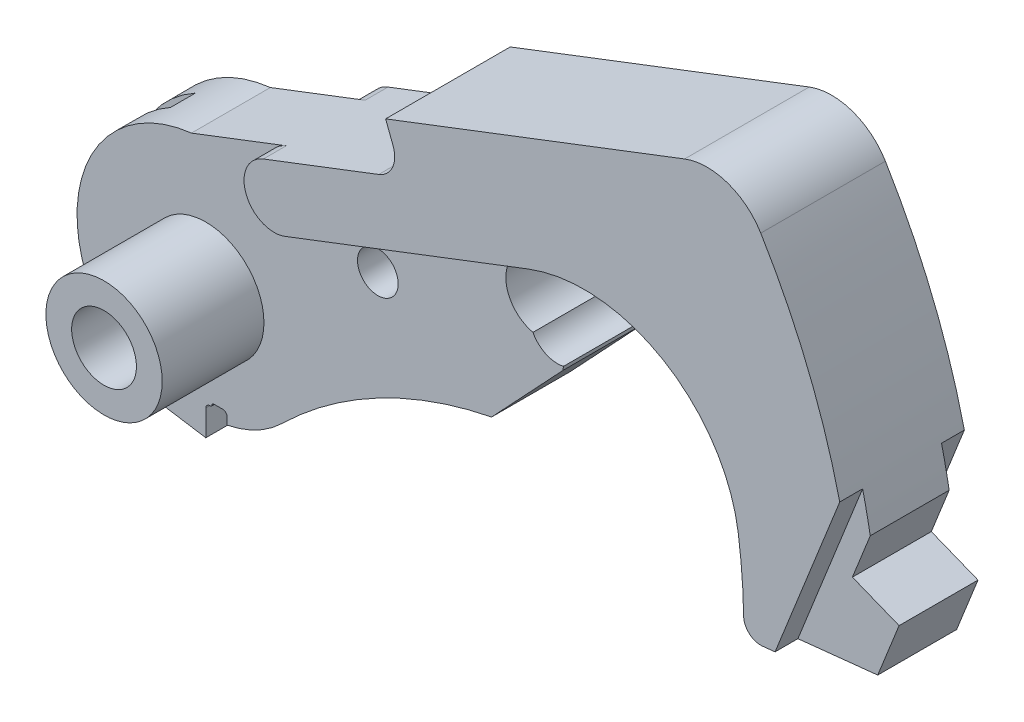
ISO-10303-21;
HEADER;
FILE_DESCRIPTION(('STEP AP214'),'2;1');
FILE_NAME('part.step','',(''),(''),'','','');
FILE_SCHEMA(('AUTOMOTIVE_DESIGN { 1 0 10303 214 1 1 1 1 }'));
ENDSEC;
DATA;
#1=APPLICATION_CONTEXT('core data for automotive mechanical design processes');
#2=APPLICATION_PROTOCOL_DEFINITION('international standard','automotive_design',2000,#1);
#3=PRODUCT_CONTEXT('',#1,'mechanical');
#4=PRODUCT('Part','Part','',(#3));
#5=PRODUCT_RELATED_PRODUCT_CATEGORY('part','',(#4));
#6=PRODUCT_DEFINITION_FORMATION('','',#4);
#7=PRODUCT_DEFINITION_CONTEXT('part definition',#1,'design');
#8=PRODUCT_DEFINITION('design','',#6,#7);
#9=PRODUCT_DEFINITION_SHAPE('','',#8);
#10=(LENGTH_UNIT() NAMED_UNIT(*) SI_UNIT(.MILLI.,.METRE.));
#11=(NAMED_UNIT(*) PLANE_ANGLE_UNIT() SI_UNIT($,.RADIAN.));
#12=(NAMED_UNIT(*) SI_UNIT($,.STERADIAN.) SOLID_ANGLE_UNIT());
#13=UNCERTAINTY_MEASURE_WITH_UNIT(LENGTH_MEASURE(1.E-05),#10,'distance_accuracy_value','');
#14=(GEOMETRIC_REPRESENTATION_CONTEXT(3) GLOBAL_UNCERTAINTY_ASSIGNED_CONTEXT((#13)) GLOBAL_UNIT_ASSIGNED_CONTEXT((#10,
#11,#12)) REPRESENTATION_CONTEXT('',''));
#15=CARTESIAN_POINT('',(0.,0.,0.));
#16=DIRECTION('',(0.,0.,1.));
#17=DIRECTION('',(1.,0.,0.));
#18=AXIS2_PLACEMENT_3D('',#15,#16,#17);
#19=CARTESIAN_POINT('',(0.,0.,2.413));
#20=DIRECTION('',(0.,0.,-1.));
#21=DIRECTION('',(-1.,0.,0.));
#22=AXIS2_PLACEMENT_3D('',#19,#20,#21);
#23=CYLINDRICAL_SURFACE('',#22,7.874);
#24=CARTESIAN_POINT('',(0.,0.,-2.413));
#25=DIRECTION('',(0.,0.,1.));
#26=DIRECTION('',(1.,0.,0.));
#27=AXIS2_PLACEMENT_3D('',#24,#25,#26);
#28=CIRCLE('',#27,7.874);
#29=CARTESIAN_POINT('',(-0.878723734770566,7.82481441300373,-2.413));
#30=VERTEX_POINT('',#29);
#31=CARTESIAN_POINT('',(-2.43319981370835,-7.48861900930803,-2.413));
#32=VERTEX_POINT('',#31);
#33=EDGE_CURVE('E511',#30,#32,#28,.T.);
#34=ORIENTED_EDGE('',*,*,#33,.T.);
#35=DIRECTION('',(0.,0.,-1.));
#36=VECTOR('',#35,1.);
#37=CARTESIAN_POINT('',(-2.43319981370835,-7.48861900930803,2.413));
#38=LINE('',#37,#36);
#39=CARTESIAN_POINT('',(-2.43319981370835,-7.48861900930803,2.413));
#40=VERTEX_POINT('',#39);
#41=EDGE_CURVE('E554',#40,#32,#38,.T.);
#42=ORIENTED_EDGE('',*,*,#41,.F.);
#43=CARTESIAN_POINT('',(0.,0.,2.413));
#44=DIRECTION('',(0.,0.,1.));
#45=DIRECTION('',(1.,0.,0.));
#46=AXIS2_PLACEMENT_3D('',#43,#44,#45);
#47=CIRCLE('',#46,7.874);
#48=CARTESIAN_POINT('',(-0.878723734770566,7.82481441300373,2.413));
#49=VERTEX_POINT('',#48);
#50=EDGE_CURVE('E552',#49,#40,#47,.T.);
#51=ORIENTED_EDGE('',*,*,#50,.F.);
#52=DIRECTION('',(0.,0.,-1.));
#53=VECTOR('',#52,1.);
#54=CARTESIAN_POINT('',(-0.878723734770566,7.82481441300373,2.413));
#55=LINE('',#54,#53);
#56=EDGE_CURVE('E604',#49,#30,#55,.T.);
#57=ORIENTED_EDGE('',*,*,#56,.T.);
#58=EDGE_LOOP('',(#34,#42,#51,#57));
#59=FACE_BOUND('',#58,.T.);
#60=CARTESIAN_POINT('',(-7.51774857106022,-2.34165164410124,0.));
#61=CARTESIAN_POINT('',(-7.51775038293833,-2.34164911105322,0.0825181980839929));
#62=CARTESIAN_POINT('',(-7.51983001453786,-2.33500124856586,0.165077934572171));
#63=CARTESIAN_POINT('',(-7.52799367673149,-2.30854332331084,0.327907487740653));
#64=CARTESIAN_POINT('',(-7.53408109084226,-2.28872213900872,0.408175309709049));
#65=CARTESIAN_POINT('',(-7.5497848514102,-2.23637368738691,0.564075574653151));
#66=CARTESIAN_POINT('',(-7.55940037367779,-2.20384938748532,0.639709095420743));
#67=CARTESIAN_POINT('',(-7.58141585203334,-2.12687665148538,0.784181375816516));
#68=CARTESIAN_POINT('',(-7.59381527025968,-2.08243051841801,0.853021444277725));
#69=CARTESIAN_POINT('',(-7.62042785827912,-1.98282593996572,0.981821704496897));
#70=CARTESIAN_POINT('',(-7.63463715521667,-1.92769024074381,1.04180028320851));
#71=CARTESIAN_POINT('',(-7.6638415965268,-1.80808971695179,1.15136060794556));
#72=CARTESIAN_POINT('',(-7.67883671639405,-1.74362518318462,1.20094267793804));
#73=CARTESIAN_POINT('',(-7.70851323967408,-1.60733966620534,1.28824195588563));
#74=CARTESIAN_POINT('',(-7.72319546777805,-1.5355419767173,1.32599527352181));
#75=CARTESIAN_POINT('',(-7.75135145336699,-1.38642680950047,1.38894656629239));
#76=CARTESIAN_POINT('',(-7.76482519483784,-1.30910925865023,1.41414437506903));
#77=CARTESIAN_POINT('',(-7.78993407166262,-1.15035585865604,1.45171840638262));
#78=CARTESIAN_POINT('',(-7.80155072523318,-1.06888811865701,1.46397182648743));
#79=CARTESIAN_POINT('',(-7.82228721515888,-0.904735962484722,1.47522824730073));
#80=CARTESIAN_POINT('',(-7.8314066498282,-0.822051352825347,1.4742291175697));
#81=CARTESIAN_POINT('',(-7.84719018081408,-0.654807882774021,1.45907142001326));
#82=CARTESIAN_POINT('',(-7.853760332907,-0.570280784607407,1.44446692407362));
#83=CARTESIAN_POINT('',(-7.86404794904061,-0.40440214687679,1.40211765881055));
#84=CARTESIAN_POINT('',(-7.86776463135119,-0.323051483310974,1.37436929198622));
#85=CARTESIAN_POINT('',(-7.87276449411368,-0.161984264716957,1.30499484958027));
#86=CARTESIAN_POINT('',(-7.8739290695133,-0.0825110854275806,1.26279402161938));
#87=CARTESIAN_POINT('',(-7.87406468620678,0.0684870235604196,1.16594431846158));
#88=CARTESIAN_POINT('',(-7.87303514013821,0.140009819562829,1.11129211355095));
#89=CARTESIAN_POINT('',(-7.86953029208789,0.273679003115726,0.989950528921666));
#90=CARTESIAN_POINT('',(-7.86703674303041,0.335694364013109,0.923116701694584));
#91=CARTESIAN_POINT('',(-7.86151207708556,0.446773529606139,0.779431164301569));
#92=CARTESIAN_POINT('',(-7.85848118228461,0.495842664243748,0.702583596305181));
#93=CARTESIAN_POINT('',(-7.85299124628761,0.576138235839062,0.545792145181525));
#94=CARTESIAN_POINT('',(-7.85050887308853,0.608254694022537,0.466306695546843));
#95=CARTESIAN_POINT('',(-7.84657086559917,0.657127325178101,0.302733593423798));
#96=CARTESIAN_POINT('',(-7.8451143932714,0.673896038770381,0.218649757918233));
#97=CARTESIAN_POINT('',(-7.84369077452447,0.690251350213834,0.0568074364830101));
#98=CARTESIAN_POINT('',(-7.8435967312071,0.691302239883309,-0.0208044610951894));
#99=CARTESIAN_POINT('',(-7.84459204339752,0.679915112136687,-0.175014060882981));
#100=CARTESIAN_POINT('',(-7.84568120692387,0.667479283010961,-0.251611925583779));
#101=CARTESIAN_POINT('',(-7.84874481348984,0.630402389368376,-0.399063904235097));
#102=CARTESIAN_POINT('',(-7.85068900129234,0.60617566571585,-0.470024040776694));
#103=CARTESIAN_POINT('',(-7.85504750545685,0.546796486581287,-0.60718487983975));
#104=CARTESIAN_POINT('',(-7.85746191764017,0.511641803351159,-0.67338460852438));
#105=CARTESIAN_POINT('',(-7.86239505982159,0.429424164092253,-0.803286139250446));
#106=CARTESIAN_POINT('',(-7.86491186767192,0.381795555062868,-0.866629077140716));
#107=CARTESIAN_POINT('',(-7.86928535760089,0.277402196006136,-0.98529723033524));
#108=CARTESIAN_POINT('',(-7.87114177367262,0.220633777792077,-1.04061920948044));
#109=CARTESIAN_POINT('',(-7.87371533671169,0.0940207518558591,-1.14693745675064));
#110=CARTESIAN_POINT('',(-7.87431327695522,0.0234560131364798,-1.19708040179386));
#111=CARTESIAN_POINT('',(-7.87336148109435,-0.124667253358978,-1.28567186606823));
#112=CARTESIAN_POINT('',(-7.87181101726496,-0.202228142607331,-1.32411641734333));
#113=CARTESIAN_POINT('',(-7.86591414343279,-0.366566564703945,-1.39008205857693));
#114=CARTESIAN_POINT('',(-7.86142470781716,-0.453614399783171,-1.41692079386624));
#115=CARTESIAN_POINT('',(-7.84919671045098,-0.630764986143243,-1.45565424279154));
#116=CARTESIAN_POINT('',(-7.84145834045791,-0.72086755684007,-1.46754983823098));
#117=CARTESIAN_POINT('',(-7.82288973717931,-0.900152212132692,-1.47562405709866));
#118=CARTESIAN_POINT('',(-7.81210600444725,-0.989328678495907,-1.47202826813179));
#119=CARTESIAN_POINT('',(-7.78780000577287,-1.16530272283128,-1.44931827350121));
#120=CARTESIAN_POINT('',(-7.77427855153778,-1.25210099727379,-1.43020866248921));
#121=CARTESIAN_POINT('',(-7.74595315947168,-1.41659273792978,-1.37796293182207));
#122=CARTESIAN_POINT('',(-7.73123800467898,-1.49452186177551,-1.34551980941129));
#123=CARTESIAN_POINT('',(-7.70098369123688,-1.64331776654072,-1.26749191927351));
#124=CARTESIAN_POINT('',(-7.68544470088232,-1.71418598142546,-1.22190982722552));
#125=CARTESIAN_POINT('',(-7.65515598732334,-1.84467314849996,-1.12048911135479));
#126=CARTESIAN_POINT('',(-7.64039679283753,-1.90457512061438,-1.065016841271));
#127=CARTESIAN_POINT('',(-7.61223688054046,-2.01418361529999,-0.944465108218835));
#128=CARTESIAN_POINT('',(-7.59883634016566,-2.06388880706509,-0.879384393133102));
#129=CARTESIAN_POINT('',(-7.57447797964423,-2.15156330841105,-0.741887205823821));
#130=CARTESIAN_POINT('',(-7.56350659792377,-2.18959825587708,-0.6695149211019));
#131=CARTESIAN_POINT('',(-7.54475131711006,-2.25337898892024,-0.519209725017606));
#132=CARTESIAN_POINT('',(-7.53696480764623,-2.27913484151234,-0.441281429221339));
#133=CARTESIAN_POINT('',(-7.5266874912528,-2.31280544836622,-0.30264634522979));
#134=CARTESIAN_POINT('',(-7.52334861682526,-2.32360906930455,-0.242685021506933));
#135=CARTESIAN_POINT('',(-7.51887848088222,-2.33803312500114,-0.121823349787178));
#136=CARTESIAN_POINT('',(-7.51774723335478,-2.34165351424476,-0.0609229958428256));
#137=CARTESIAN_POINT('',(-7.51774857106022,-2.34165164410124,0.));
#138=B_SPLINE_CURVE_WITH_KNOTS('',3,(#60,#61,#62,#63,#64,#65,#66,#67,#68,#69,#70,#71,#72,#73,
#74,#75,#76,#77,#78,#79,#80,#81,#82,#83,#84,#85,#86,#87,#88,#89,#90,#91,#92,#93,#94,#95,#96,#97,
#98,#99,#100,#101,#102,#103,#104,#105,#106,#107,#108,#109,#110,#111,#112,#113,#114,#115,#116,
#117,#118,#119,#120,#121,#122,#123,#124,#125,#126,#127,#128,#129,#130,#131,#132,#133,#134,#135,
#136,#137),.UNSPECIFIED.,.T.,.F.,(4,2,2,2,2,2,2,2,2,2,2,2,2,2,2,2,2,2,2,2,2,2,2,2,2,2,2,2,2,2,2,
2,2,2,2,2,2,2,4),(0.,0.247335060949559,0.494879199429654,0.742365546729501,0.989804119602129,
1.2367218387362,1.48363186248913,1.72978062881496,1.97593265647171,2.22439949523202,
2.47290627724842,2.72985587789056,2.986875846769,3.25560749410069,3.52441108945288,
3.79663834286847,4.06875334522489,4.32462991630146,4.58029722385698,4.81198024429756,
5.04362567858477,5.26766193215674,5.49174388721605,5.72862970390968,5.96561083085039,
6.22418294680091,6.48284266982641,6.75513231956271,7.027405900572,7.29572810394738,
7.56397086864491,7.81974976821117,8.07547661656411,8.32318618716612,8.57092806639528,
8.8172498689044,9.06336937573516,9.24597512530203,9.42858203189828),.UNSPECIFIED.);
#139=CARTESIAN_POINT('',(-7.57834347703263,-2.13742512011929,0.762));
#140=VERTEX_POINT('',#139);
#141=CARTESIAN_POINT('',(-7.8608321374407,0.455185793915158,0.761999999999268));
#142=VERTEX_POINT('',#141);
#143=EDGE_CURVE('E360',#140,#142,#138,.T.);
#144=ORIENTED_EDGE('',*,*,#143,.F.);
#145=CARTESIAN_POINT('',(0.,0.,0.762));
#146=DIRECTION('',(0.,0.,1.));
#147=DIRECTION('',(1.,0.,0.));
#148=AXIS2_PLACEMENT_3D('',#145,#146,#147);
#149=CIRCLE('',#148,7.874);
#150=CARTESIAN_POINT('',(-3.81,-6.89084726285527,0.762));
#151=VERTEX_POINT('',#150);
#152=EDGE_CURVE('E62',#140,#151,#149,.T.);
#153=ORIENTED_EDGE('',*,*,#152,.T.);
#154=DIRECTION('',(0.,0.,1.));
#155=VECTOR('',#154,1.);
#156=CARTESIAN_POINT('',(-3.81,-6.89084726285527,-0.762));
#157=LINE('',#156,#155);
#158=CARTESIAN_POINT('',(-3.81,-6.89084726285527,-0.762));
#159=VERTEX_POINT('',#158);
#160=EDGE_CURVE('E1286',#159,#151,#157,.T.);
#161=ORIENTED_EDGE('',*,*,#160,.F.);
#162=CARTESIAN_POINT('',(0.,0.,-0.762));
#163=DIRECTION('',(0.,0.,1.));
#164=DIRECTION('',(1.,0.,0.));
#165=AXIS2_PLACEMENT_3D('',#162,#163,#164);
#166=CIRCLE('',#165,7.874);
#167=CARTESIAN_POINT('',(-7.57834347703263,-2.13742512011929,-0.762));
#168=VERTEX_POINT('',#167);
#169=EDGE_CURVE('E1295',#168,#159,#166,.T.);
#170=ORIENTED_EDGE('',*,*,#169,.F.);
#171=CARTESIAN_POINT('',(-7.86083213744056,0.4551857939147,-0.761999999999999));
#172=VERTEX_POINT('',#171);
#173=EDGE_CURVE('E367',#172,#168,#138,.T.);
#174=ORIENTED_EDGE('',*,*,#173,.F.);
#175=CARTESIAN_POINT('',(-3.81,6.89084726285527,-0.762));
#176=VERTEX_POINT('',#175);
#177=EDGE_CURVE('E387',#176,#172,#166,.T.);
#178=ORIENTED_EDGE('',*,*,#177,.F.);
#179=DIRECTION('',(0.,0.,1.));
#180=VECTOR('',#179,1.);
#181=CARTESIAN_POINT('',(-3.81,6.89084726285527,-0.762));
#182=LINE('',#181,#180);
#183=CARTESIAN_POINT('',(-3.81,6.89084726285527,0.762));
#184=VERTEX_POINT('',#183);
#185=EDGE_CURVE('E1223',#176,#184,#182,.T.);
#186=ORIENTED_EDGE('',*,*,#185,.T.);
#187=EDGE_CURVE('E1297',#184,#142,#149,.T.);
#188=ORIENTED_EDGE('',*,*,#187,.T.);
#189=EDGE_LOOP('',(#144,#153,#161,#170,#174,#178,#186,#188));
#190=FACE_BOUND('',#189,.T.);
#191=ADVANCED_FACE('F33',(#59,#190),#23,.T.);
#192=CARTESIAN_POINT('',(0.,0.,8.636));
#193=DIRECTION('',(0.,0.,-1.));
#194=DIRECTION('',(-1.,0.,0.));
#195=AXIS2_PLACEMENT_3D('',#192,#193,#194);
#196=CYLINDRICAL_SURFACE('',#195,1.9812);
#197=CARTESIAN_POINT('',(0.,0.,-8.636));
#198=DIRECTION('',(0.,0.,1.));
#199=DIRECTION('',(1.,0.,0.));
#200=AXIS2_PLACEMENT_3D('',#197,#198,#199);
#201=CIRCLE('',#200,1.9812);
#202=CARTESIAN_POINT('',(1.9812,0.,-8.636));
#203=VERTEX_POINT('',#202);
#204=EDGE_CURVE('E412',#203,#203,#201,.T.);
#205=ORIENTED_EDGE('',*,*,#204,.F.);
#206=EDGE_LOOP('',(#205));
#207=FACE_BOUND('',#206,.T.);
#208=CARTESIAN_POINT('',(0.,0.,8.636));
#209=DIRECTION('',(0.,0.,1.));
#210=DIRECTION('',(1.,0.,0.));
#211=AXIS2_PLACEMENT_3D('',#208,#209,#210);
#212=CIRCLE('',#211,1.9812);
#213=CARTESIAN_POINT('',(1.9812,0.,8.636));
#214=VERTEX_POINT('',#213);
#215=EDGE_CURVE('E413',#214,#214,#212,.T.);
#216=ORIENTED_EDGE('',*,*,#215,.T.);
#217=EDGE_LOOP('',(#216));
#218=FACE_BOUND('',#217,.T.);
#219=CARTESIAN_POINT('',(-1.9812,0.,0.744557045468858));
#220=CARTESIAN_POINT('',(-1.98119912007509,0.0390060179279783,0.80672345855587));
#221=CARTESIAN_POINT('',(-1.98005558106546,0.0830707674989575,0.865746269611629));
#222=CARTESIAN_POINT('',(-1.97360375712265,0.179972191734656,0.975840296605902));
#223=CARTESIAN_POINT('',(-1.96829565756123,0.232808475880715,1.02691186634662));
#224=CARTESIAN_POINT('',(-1.95172002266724,0.345197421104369,1.11995601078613));
#225=CARTESIAN_POINT('',(-1.94044907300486,0.40475391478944,1.16192335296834));
#226=CARTESIAN_POINT('',(-1.91063785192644,0.527846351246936,1.23632045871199));
#227=CARTESIAN_POINT('',(-1.89209727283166,0.591382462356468,1.26874981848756));
#228=CARTESIAN_POINT('',(-1.84730898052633,0.719134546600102,1.32441611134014));
#229=CARTESIAN_POINT('',(-1.82111452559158,0.783342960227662,1.34771404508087));
#230=CARTESIAN_POINT('',(-1.76102709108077,0.910432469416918,1.38669392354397));
#231=CARTESIAN_POINT('',(-1.72713052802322,0.973312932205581,1.40237231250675));
#232=CARTESIAN_POINT('',(-1.64723494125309,1.10379017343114,1.42936300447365));
#233=CARTESIAN_POINT('',(-1.60023714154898,1.17094332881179,1.43984706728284));
#234=CARTESIAN_POINT('',(-1.4979355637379,1.29926712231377,1.45552601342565));
#235=CARTESIAN_POINT('',(-1.44262579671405,1.36043339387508,1.46071706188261));
#236=CARTESIAN_POINT('',(-1.3128991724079,1.48701538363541,1.46863328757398));
#237=CARTESIAN_POINT('',(-1.2368736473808,1.55083193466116,1.47065710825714));
#238=CARTESIAN_POINT('',(-1.07612911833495,1.66640787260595,1.4728761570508));
#239=CARTESIAN_POINT('',(-0.991406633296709,1.71816240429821,1.47307065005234));
#240=CARTESIAN_POINT('',(-0.80528858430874,1.81349730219,1.47325217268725));
#241=CARTESIAN_POINT('',(-0.703087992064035,1.85551642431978,1.47321357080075));
#242=CARTESIAN_POINT('',(-0.493077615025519,1.9220226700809,1.4731778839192));
#243=CARTESIAN_POINT('',(-0.385264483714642,1.94649920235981,1.47318082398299));
#244=CARTESIAN_POINT('',(-0.165734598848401,1.97740391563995,1.47146485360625));
#245=CARTESIAN_POINT('',(-0.0539861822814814,1.98360700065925,1.46972481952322));
#246=CARTESIAN_POINT('',(0.168745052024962,1.97713083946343,1.46075696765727));
#247=CARTESIAN_POINT('',(0.279728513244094,1.96447010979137,1.45353453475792));
#248=CARTESIAN_POINT('',(0.472011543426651,1.92604832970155,1.43122687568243));
#249=CARTESIAN_POINT('',(0.554294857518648,1.90394562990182,1.41831769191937));
#250=CARTESIAN_POINT('',(0.713619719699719,1.85011969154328,1.38336450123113));
#251=CARTESIAN_POINT('',(0.790666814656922,1.81840683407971,1.36133034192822));
#252=CARTESIAN_POINT('',(0.937492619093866,1.74727390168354,1.30542738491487));
#253=CARTESIAN_POINT('',(1.0072033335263,1.70779006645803,1.27145872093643));
#254=CARTESIAN_POINT('',(1.1358821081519,1.62504634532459,1.19030870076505));
#255=CARTESIAN_POINT('',(1.19485807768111,1.58178927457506,1.14313713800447));
#256=CARTESIAN_POINT('',(1.29305504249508,1.50219914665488,1.04350674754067));
#257=CARTESIAN_POINT('',(1.33388643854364,1.46574558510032,0.992716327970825));
#258=CARTESIAN_POINT('',(1.40633011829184,1.39639120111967,0.882811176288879));
#259=CARTESIAN_POINT('',(1.43794101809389,1.36349091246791,0.823695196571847));
#260=CARTESIAN_POINT('',(1.49185297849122,1.30426493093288,0.700083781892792));
#261=CARTESIAN_POINT('',(1.51432937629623,1.27781974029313,0.635721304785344));
#262=CARTESIAN_POINT('',(1.55160054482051,1.23229728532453,0.502342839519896));
#263=CARTESIAN_POINT('',(1.56639406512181,1.21322122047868,0.433326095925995));
#264=CARTESIAN_POINT('',(1.58962173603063,1.18264601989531,0.288248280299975));
#265=CARTESIAN_POINT('',(1.59763184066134,1.17165710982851,0.212011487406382));
#266=CARTESIAN_POINT('',(1.60626089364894,1.15979846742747,0.0583329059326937));
#267=CARTESIAN_POINT('',(1.60687791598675,1.15893137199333,-0.0191091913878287));
#268=CARTESIAN_POINT('',(1.60065306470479,1.16751633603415,-0.17575497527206));
#269=CARTESIAN_POINT('',(1.59355893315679,1.1773174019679,-0.254929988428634));
#270=CARTESIAN_POINT('',(1.57104816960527,1.2071900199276,-0.410112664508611));
#271=CARTESIAN_POINT('',(1.55563092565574,1.22726232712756,-0.486120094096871));
#272=CARTESIAN_POINT('',(1.51576408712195,1.27616463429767,-0.632150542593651));
#273=CARTESIAN_POINT('',(1.4913785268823,1.30493229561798,-0.702211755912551));
#274=CARTESIAN_POINT('',(1.4326504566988,1.36914105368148,-0.834669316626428));
#275=CARTESIAN_POINT('',(1.39831427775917,1.40457790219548,-0.897070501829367));
#276=CARTESIAN_POINT('',(1.32114664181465,1.47728862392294,-1.0093566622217));
#277=CARTESIAN_POINT('',(1.27883087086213,1.51437975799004,-1.05971410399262));
#278=CARTESIAN_POINT('',(1.18499878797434,1.58886969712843,-1.15064644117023));
#279=CARTESIAN_POINT('',(1.13348570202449,1.62626838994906,-1.19122475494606));
#280=CARTESIAN_POINT('',(1.02465484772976,1.6968401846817,-1.26096214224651));
#281=CARTESIAN_POINT('',(0.967663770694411,1.73012391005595,-1.29052288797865));
#282=CARTESIAN_POINT('',(0.847704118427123,1.79195689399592,-1.34122831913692));
#283=CARTESIAN_POINT('',(0.784733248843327,1.82050432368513,-1.36236975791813));
#284=CARTESIAN_POINT('',(0.649443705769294,1.87324431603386,-1.39889882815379));
#285=CARTESIAN_POINT('',(0.576778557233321,1.89693353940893,-1.41371934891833));
#286=CARTESIAN_POINT('',(0.428269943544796,1.93588413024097,-1.43711218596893));
#287=CARTESIAN_POINT('',(0.352424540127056,1.95114027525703,-1.44568063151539));
#288=CARTESIAN_POINT('',(0.184522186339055,1.97473756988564,-1.45974883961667));
#289=CARTESIAN_POINT('',(0.0921272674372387,1.98120988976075,-1.4643541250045));
#290=CARTESIAN_POINT('',(-0.0927719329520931,1.98119006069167,-1.47028900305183));
#291=CARTESIAN_POINT('',(-0.1852762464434,1.97468942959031,-1.47161645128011));
#292=CARTESIAN_POINT('',(-0.383261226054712,1.94673852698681,-1.47316646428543));
#293=CARTESIAN_POINT('',(-0.488434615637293,1.92305088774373,-1.47317685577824));
#294=CARTESIAN_POINT('',(-0.693557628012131,1.85894700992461,-1.47321224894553));
#295=CARTESIAN_POINT('',(-0.793506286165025,1.81852769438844,-1.47323725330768));
#296=CARTESIAN_POINT('',(-0.988985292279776,1.72030724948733,-1.47309610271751));
#297=CARTESIAN_POINT('',(-1.08422847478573,1.66193453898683,-1.47292305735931));
#298=CARTESIAN_POINT('',(-1.26368625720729,1.52991604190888,-1.47009483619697));
#299=CARTESIAN_POINT('',(-1.34789045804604,1.45625602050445,-1.46743733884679));
#300=CARTESIAN_POINT('',(-1.46357278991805,1.33648137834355,-1.45848650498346));
#301=CARTESIAN_POINT('',(-1.50028124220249,1.29512836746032,-1.45469169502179));
#302=CARTESIAN_POINT('',(-1.56998940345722,1.20967739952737,-1.44479733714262));
#303=CARTESIAN_POINT('',(-1.6029913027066,1.16558108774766,-1.43869915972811));
#304=CARTESIAN_POINT('',(-1.66493450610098,1.07523900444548,-1.42351333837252));
#305=CARTESIAN_POINT('',(-1.69388438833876,1.02899805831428,-1.41443215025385));
#306=CARTESIAN_POINT('',(-1.74753731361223,0.934985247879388,-1.39256450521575));
#307=CARTESIAN_POINT('',(-1.77224264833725,0.887214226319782,-1.37978005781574));
#308=CARTESIAN_POINT('',(-1.82560763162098,0.77304636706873,-1.34422908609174));
#309=CARTESIAN_POINT('',(-1.85233078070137,0.706318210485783,-1.31951876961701));
#310=CARTESIAN_POINT('',(-1.89740521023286,0.574343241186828,-1.26046246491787));
#311=CARTESIAN_POINT('',(-1.91576301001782,0.509095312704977,-1.22612401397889));
#312=CARTESIAN_POINT('',(-1.94491802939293,0.38295611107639,-1.14717932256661));
#313=CARTESIAN_POINT('',(-1.95569100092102,0.322079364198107,-1.10254075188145));
#314=CARTESIAN_POINT('',(-1.97111448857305,0.207838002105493,-1.00360905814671));
#315=CARTESIAN_POINT('',(-1.97576322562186,0.154475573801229,-0.949313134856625));
#316=CARTESIAN_POINT('',(-1.98083414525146,0.0598978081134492,-0.835433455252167));
#317=CARTESIAN_POINT('',(-1.98145592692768,0.0182087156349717,-0.776249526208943));
#318=CARTESIAN_POINT('',(-1.98077077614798,-0.0552670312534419,-0.652044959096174));
#319=CARTESIAN_POINT('',(-1.97946355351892,-0.0870521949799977,-0.587023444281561));
#320=CARTESIAN_POINT('',(-1.97634915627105,-0.141336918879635,-0.449708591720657));
#321=CARTESIAN_POINT('',(-1.97452152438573,-0.163334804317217,-0.377217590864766));
#322=CARTESIAN_POINT('',(-1.97159786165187,-0.195490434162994,-0.229627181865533));
#323=CARTESIAN_POINT('',(-1.97050211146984,-0.20564363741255,-0.15452678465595));
#324=CARTESIAN_POINT('',(-1.96959317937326,-0.214193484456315,9.94473115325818E-06));
#325=CARTESIAN_POINT('',(-1.96984476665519,-0.211996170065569,0.0794799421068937));
#326=CARTESIAN_POINT('',(-1.97165230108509,-0.194469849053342,0.236919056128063));
#327=CARTESIAN_POINT('',(-1.97320757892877,-0.179147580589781,0.314888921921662));
#328=CARTESIAN_POINT('',(-1.97635575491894,-0.139573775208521,0.453215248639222));
#329=CARTESIAN_POINT('',(-1.97789013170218,-0.117458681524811,0.514191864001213));
#330=CARTESIAN_POINT('',(-1.98031259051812,-0.06487335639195,0.632446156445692));
#331=CARTESIAN_POINT('',(-1.98120077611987,-0.0344044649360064,0.68972442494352));
#332=CARTESIAN_POINT('',(-1.9812,0.,0.744557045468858));
#333=B_SPLINE_CURVE_WITH_KNOTS('',3,(#219,#220,#221,#222,#223,#224,#225,#226,#227,#228,#229,
#230,#231,#232,#233,#234,#235,#236,#237,#238,#239,#240,#241,#242,#243,#244,#245,#246,#247,#248,
#249,#250,#251,#252,#253,#254,#255,#256,#257,#258,#259,#260,#261,#262,#263,#264,#265,#266,#267,
#268,#269,#270,#271,#272,#273,#274,#275,#276,#277,#278,#279,#280,#281,#282,#283,#284,#285,#286,
#287,#288,#289,#290,#291,#292,#293,#294,#295,#296,#297,#298,#299,#300,#301,#302,#303,#304,#305,
#306,#307,#308,#309,#310,#311,#312,#313,#314,#315,#316,#317,#318,#319,#320,#321,#322,#323,#324,
#325,#326,#327,#328,#329,#330,#331,#332),.UNSPECIFIED.,.T.,.F.,(4,2,2,2,2,2,2,2,2,2,2,2,2,2,2,2,
2,2,2,2,2,2,2,2,2,2,2,2,2,2,2,2,2,2,2,2,2,2,2,2,2,2,2,2,2,2,2,2,2,2,2,2,2,2,2,2,4),(0.,
0.219947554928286,0.439885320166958,0.659949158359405,0.880022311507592,1.09859917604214,
1.31727794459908,1.56427305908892,1.81144699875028,2.10808512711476,2.40484245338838,
2.73478446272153,3.06492550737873,3.39911663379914,3.7329799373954,3.99048685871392,
4.24771660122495,4.50715218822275,4.76639584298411,4.98929455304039,5.21222670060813,
5.43065070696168,5.64911025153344,5.88038735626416,6.1117247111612,6.35086406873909,
6.59002101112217,6.82750249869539,7.06483322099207,7.29019642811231,7.51548074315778,
7.73148114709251,7.94756476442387,8.18025610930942,8.41309139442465,8.69024289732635,
8.96757567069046,9.28953698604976,9.61155753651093,9.94513121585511,10.2790169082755,
10.4450994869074,10.6110834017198,10.7767104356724,10.9422477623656,11.1692349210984,
11.3960448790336,11.6235766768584,11.8511745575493,12.0673990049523,12.2836559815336,
12.5099895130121,12.7364097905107,12.9738093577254,13.2110871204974,13.4051184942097,
13.5991187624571),.UNSPECIFIED.);
#334=CARTESIAN_POINT('',(-1.9812,0.,0.744557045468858));
#335=VERTEX_POINT('',#334);
#336=EDGE_CURVE('E380',#335,#335,#333,.T.);
#337=ORIENTED_EDGE('',*,*,#336,.T.);
#338=EDGE_LOOP('',(#337));
#339=FACE_BOUND('',#338,.T.);
#340=ADVANCED_FACE('F341',(#207,#218,#339),#196,.F.);
#341=CARTESIAN_POINT('',(10.5209277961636,6.16075825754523,2.413));
#342=DIRECTION('',(0.,0.,-1.));
#343=DIRECTION('',(-1.,0.,0.));
#344=AXIS2_PLACEMENT_3D('',#341,#342,#343);
#345=CYLINDRICAL_SURFACE('',#344,1.2446);
#346=CARTESIAN_POINT('',(11.7562651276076,6.00919692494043,0.));
#347=CARTESIAN_POINT('',(11.7562664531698,6.00919938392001,-0.0307211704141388));
#348=CARTESIAN_POINT('',(11.7566115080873,6.01194248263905,-0.0614874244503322));
#349=CARTESIAN_POINT('',(11.7578630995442,6.02274335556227,-0.12209789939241));
#350=CARTESIAN_POINT('',(11.7587709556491,6.03081362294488,-0.151939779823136));
#351=CARTESIAN_POINT('',(11.7607879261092,6.05174042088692,-0.209713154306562));
#352=CARTESIAN_POINT('',(11.7618960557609,6.06457384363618,-0.237653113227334));
#353=CARTESIAN_POINT('',(11.763848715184,6.09442747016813,-0.291186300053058));
#354=CARTESIAN_POINT('',(11.7646932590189,6.11144745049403,-0.316779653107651));
#355=CARTESIAN_POINT('',(11.7656482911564,6.1504366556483,-0.366940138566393));
#356=CARTESIAN_POINT('',(11.7657013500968,6.17267457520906,-0.391299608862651));
#357=CARTESIAN_POINT('',(11.7643204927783,6.22057303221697,-0.436352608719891));
#358=CARTESIAN_POINT('',(11.762885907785,6.24623510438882,-0.4570444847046));
#359=CARTESIAN_POINT('',(11.7578398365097,6.30182437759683,-0.495338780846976));
#360=CARTESIAN_POINT('',(11.7541075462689,6.33191222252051,-0.512694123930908));
#361=CARTESIAN_POINT('',(11.7438573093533,6.39413356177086,-0.542114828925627));
#362=CARTESIAN_POINT('',(11.7373409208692,6.4262659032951,-0.554183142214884));
#363=CARTESIAN_POINT('',(11.7217806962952,6.48934336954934,-0.571892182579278));
#364=CARTESIAN_POINT('',(11.7129252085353,6.52023294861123,-0.577894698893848));
#365=CARTESIAN_POINT('',(11.6926182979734,6.58172964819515,-0.584484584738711));
#366=CARTESIAN_POINT('',(11.6811682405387,6.61233690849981,-0.585074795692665));
#367=CARTESIAN_POINT('',(11.6570129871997,6.66991428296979,-0.580982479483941));
#368=CARTESIAN_POINT('',(11.6444719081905,6.69698313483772,-0.576701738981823));
#369=CARTESIAN_POINT('',(11.6179759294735,6.74929411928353,-0.563696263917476));
#370=CARTESIAN_POINT('',(11.6040209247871,6.77453611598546,-0.554971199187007));
#371=CARTESIAN_POINT('',(11.5750784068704,6.82303135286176,-0.533244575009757));
#372=CARTESIAN_POINT('',(11.5600786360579,6.84624948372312,-0.520181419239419));
#373=CARTESIAN_POINT('',(11.5299060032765,6.88993450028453,-0.49022235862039));
#374=CARTESIAN_POINT('',(11.5147330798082,6.91040037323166,-0.473325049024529));
#375=CARTESIAN_POINT('',(11.48362824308,6.95001388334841,-0.434503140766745));
#376=CARTESIAN_POINT('',(11.4677429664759,6.96889759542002,-0.412271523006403));
#377=CARTESIAN_POINT('',(11.4374998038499,7.003044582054,-0.364248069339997));
#378=CARTESIAN_POINT('',(11.4231428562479,7.01830563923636,-0.338454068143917));
#379=CARTESIAN_POINT('',(11.3962578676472,7.04575238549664,-0.282417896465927));
#380=CARTESIAN_POINT('',(11.3838596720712,7.05774262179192,-0.252016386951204));
#381=CARTESIAN_POINT('',(11.3629712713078,7.0773823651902,-0.188585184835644));
#382=CARTESIAN_POINT('',(11.3544774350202,7.08503590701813,-0.155557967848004));
#383=CARTESIAN_POINT('',(11.3428145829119,7.09541770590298,-0.0904445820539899));
#384=CARTESIAN_POINT('',(11.3392932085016,7.09847303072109,-0.058474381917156));
#385=CARTESIAN_POINT('',(11.3368189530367,7.1006275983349,0.00576791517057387));
#386=CARTESIAN_POINT('',(11.3378636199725,7.09972896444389,0.0380398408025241));
#387=CARTESIAN_POINT('',(11.3440904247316,7.09427099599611,0.098863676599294));
#388=CARTESIAN_POINT('',(11.3488887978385,7.09005099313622,0.12748755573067));
#389=CARTESIAN_POINT('',(11.3617119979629,7.07846473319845,0.183337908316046));
#390=CARTESIAN_POINT('',(11.3697377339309,7.07109758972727,0.210563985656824));
#391=CARTESIAN_POINT('',(11.3888290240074,7.05292265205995,0.264261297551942));
#392=CARTESIAN_POINT('',(11.4000176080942,7.0419719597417,0.290639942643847));
#393=CARTESIAN_POINT('',(11.4244810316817,7.01687020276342,0.340779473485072));
#394=CARTESIAN_POINT('',(11.4377569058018,7.00271754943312,0.364539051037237));
#395=CARTESIAN_POINT('',(11.467150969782,6.9696041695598,0.411453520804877));
#396=CARTESIAN_POINT('',(11.483421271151,6.95028872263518,0.434264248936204));
#397=CARTESIAN_POINT('',(11.5166099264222,6.90799873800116,0.475647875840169));
#398=CARTESIAN_POINT('',(11.5335284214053,6.88502340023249,0.494219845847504));
#399=CARTESIAN_POINT('',(11.5673179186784,6.8353047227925,0.526811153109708));
#400=CARTESIAN_POINT('',(11.5841841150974,6.80850847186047,0.540755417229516));
#401=CARTESIAN_POINT('',(11.6166202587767,6.75198213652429,0.563093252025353));
#402=CARTESIAN_POINT('',(11.6321911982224,6.72225433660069,0.571491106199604));
#403=CARTESIAN_POINT('',(11.659971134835,6.66333182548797,0.581857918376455));
#404=CARTESIAN_POINT('',(11.6723528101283,6.63430295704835,0.584308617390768));
#405=CARTESIAN_POINT('',(11.6948490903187,6.57540339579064,0.584084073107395));
#406=CARTESIAN_POINT('',(11.704964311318,6.54553293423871,0.581410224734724));
#407=CARTESIAN_POINT('',(11.7222273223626,6.48752498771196,0.571348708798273));
#408=CARTESIAN_POINT('',(11.7295047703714,6.4593801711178,0.564220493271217));
#409=CARTESIAN_POINT('',(11.7418569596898,6.40400031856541,0.545775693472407));
#410=CARTESIAN_POINT('',(11.7469313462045,6.37676542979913,0.534458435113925));
#411=CARTESIAN_POINT('',(11.7552623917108,6.32271186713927,0.50740455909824));
#412=CARTESIAN_POINT('',(11.7584264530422,6.29596773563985,0.491491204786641));
#413=CARTESIAN_POINT('',(11.7629438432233,6.24491941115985,0.455929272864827));
#414=CARTESIAN_POINT('',(11.7642963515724,6.22061632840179,0.436279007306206));
#415=CARTESIAN_POINT('',(11.7657140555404,6.17305489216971,0.391775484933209));
#416=CARTESIAN_POINT('',(11.7656549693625,6.15007851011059,0.366615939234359));
#417=CARTESIAN_POINT('',(11.764605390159,6.10852247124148,0.312873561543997));
#418=CARTESIAN_POINT('',(11.7636142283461,6.08994598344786,0.284288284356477));
#419=CARTESIAN_POINT('',(11.7613682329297,6.0577957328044,0.223877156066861));
#420=CARTESIAN_POINT('',(11.7601097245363,6.04429983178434,0.192009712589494));
#421=CARTESIAN_POINT('',(11.7579903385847,6.02358321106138,0.126340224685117));
#422=CARTESIAN_POINT('',(11.757128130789,6.01634142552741,0.0925450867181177));
#423=CARTESIAN_POINT('',(11.75653253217,6.01139163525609,0.0487240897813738));
#424=CARTESIAN_POINT('',(11.7564329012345,6.01056980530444,0.0389993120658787));
#425=CARTESIAN_POINT('',(11.7562989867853,6.00947204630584,0.0195178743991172));
#426=CARTESIAN_POINT('',(11.7562647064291,6.0091961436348,0.00976121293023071));
#427=CARTESIAN_POINT('',(11.7562651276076,6.00919692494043,0.));
#428=B_SPLINE_CURVE_WITH_KNOTS('',3,(#346,#347,#348,#349,#350,#351,#352,#353,#354,#355,#356,
#357,#358,#359,#360,#361,#362,#363,#364,#365,#366,#367,#368,#369,#370,#371,#372,#373,#374,#375,
#376,#377,#378,#379,#380,#381,#382,#383,#384,#385,#386,#387,#388,#389,#390,#391,#392,#393,#394,
#395,#396,#397,#398,#399,#400,#401,#402,#403,#404,#405,#406,#407,#408,#409,#410,#411,#412,#413,
#414,#415,#416,#417,#418,#419,#420,#421,#422,#423,#424,#425,#426,#427),.UNSPECIFIED.,.T.,.F.,(4,
2,2,2,2,2,2,2,2,2,2,2,2,2,2,2,2,2,2,2,2,2,2,2,2,2,2,2,2,2,2,2,2,2,2,2,2,2,2,2,4),(0.,
0.0921224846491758,0.184461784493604,0.276358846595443,0.368251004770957,0.46678079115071,
0.565354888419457,0.669615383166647,0.77381760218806,0.871353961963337,0.968839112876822,
1.05883135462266,1.14883028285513,1.24016601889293,1.33153527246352,1.43074699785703,
1.53001929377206,1.63433120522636,1.7385459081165,1.83492456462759,1.9312514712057,
2.01884370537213,2.10646062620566,2.19811481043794,2.28981456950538,2.39144546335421,
2.49309860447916,2.59632826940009,2.69947811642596,2.79394345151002,2.88838307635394,
2.97777755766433,3.06718643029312,3.16063930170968,3.25413448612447,3.35588938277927,
3.4577173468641,3.56104782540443,3.66402888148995,3.6932980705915,3.72256867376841),.UNSPECIFIED.);
#429=CARTESIAN_POINT('',(11.7562651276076,6.00919692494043,0.));
#430=VERTEX_POINT('',#429);
#431=EDGE_CURVE('E385',#430,#430,#428,.T.);
#432=ORIENTED_EDGE('',*,*,#431,.T.);
#433=EDGE_LOOP('',(#432));
#434=FACE_BOUND('',#433,.T.);
#435=CARTESIAN_POINT('',(10.5209277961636,6.16075825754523,2.413));
#436=DIRECTION('',(0.,0.,1.));
#437=DIRECTION('',(1.,0.,0.));
#438=AXIS2_PLACEMENT_3D('',#435,#436,#437);
#439=CIRCLE('',#438,1.2446);
#440=CARTESIAN_POINT('',(11.7655277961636,6.16075825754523,2.413));
#441=VERTEX_POINT('',#440);
#442=EDGE_CURVE('E456',#441,#441,#439,.T.);
#443=ORIENTED_EDGE('',*,*,#442,.T.);
#444=EDGE_LOOP('',(#443));
#445=FACE_BOUND('',#444,.T.);
#446=CARTESIAN_POINT('',(10.5209277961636,6.16075825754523,-2.413));
#447=DIRECTION('',(0.,0.,1.));
#448=DIRECTION('',(1.,0.,0.));
#449=AXIS2_PLACEMENT_3D('',#446,#447,#448);
#450=CIRCLE('',#449,1.2446);
#451=CARTESIAN_POINT('',(11.7655277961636,6.16075825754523,-2.413));
#452=VERTEX_POINT('',#451);
#453=EDGE_CURVE('E472',#452,#452,#450,.T.);
#454=ORIENTED_EDGE('',*,*,#453,.F.);
#455=EDGE_LOOP('',(#454));
#456=FACE_BOUND('',#455,.T.);
#457=CARTESIAN_POINT('',(9.27632779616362,6.16075825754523,0.377295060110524));
#458=CARTESIAN_POINT('',(9.27632780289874,6.18265999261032,0.353122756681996));
#459=CARTESIAN_POINT('',(9.27690724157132,6.20270606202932,0.327258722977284));
#460=CARTESIAN_POINT('',(9.27862251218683,6.238395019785,0.272598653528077));
#461=CARTESIAN_POINT('',(9.27975921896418,6.25403092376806,0.243798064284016));
#462=CARTESIAN_POINT('',(9.28199949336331,6.28017343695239,0.183790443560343));
#463=CARTESIAN_POINT('',(9.28310290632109,6.29065879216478,0.152574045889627));
#464=CARTESIAN_POINT('',(9.28477533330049,6.30572622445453,0.0887525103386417));
#465=CARTESIAN_POINT('',(9.28534502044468,6.31031573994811,0.0561491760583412));
#466=CARTESIAN_POINT('',(9.28569257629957,6.31315312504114,-0.00676805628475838));
#467=CARTESIAN_POINT('',(9.28552900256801,6.3118698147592,-0.0370611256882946));
#468=CARTESIAN_POINT('',(9.28460446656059,6.30410618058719,-0.0969644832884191));
#469=CARTESIAN_POINT('',(9.28384338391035,6.29762480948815,-0.126574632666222));
#470=CARTESIAN_POINT('',(9.282032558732,6.28009776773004,-0.183514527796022));
#471=CARTESIAN_POINT('',(9.28099108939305,6.26917893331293,-0.210884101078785));
#472=CARTESIAN_POINT('',(9.27900042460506,6.24330180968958,-0.263639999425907));
#473=CARTESIAN_POINT('',(9.27805125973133,6.22834218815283,-0.289025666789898));
#474=CARTESIAN_POINT('',(9.27661754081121,6.19327949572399,-0.339756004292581));
#475=CARTESIAN_POINT('',(9.27618757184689,6.17281625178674,-0.364853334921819));
#476=CARTESIAN_POINT('',(9.27655128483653,6.12834058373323,-0.411682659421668));
#477=CARTESIAN_POINT('',(9.27734564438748,6.10432620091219,-0.433412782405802));
#478=CARTESIAN_POINT('',(9.28083161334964,6.05147315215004,-0.474557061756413));
#479=CARTESIAN_POINT('',(9.28366319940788,6.02240630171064,-0.493668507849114));
#480=CARTESIAN_POINT('',(9.29194502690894,5.96185575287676,-0.526837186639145));
#481=CARTESIAN_POINT('',(9.29739425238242,5.93037299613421,-0.540896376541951));
#482=CARTESIAN_POINT('',(9.31095248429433,5.86754669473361,-0.562853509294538));
#483=CARTESIAN_POINT('',(9.31892736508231,5.8362635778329,-0.571005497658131));
#484=CARTESIAN_POINT('',(9.33763355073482,5.77357467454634,-0.581775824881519));
#485=CARTESIAN_POINT('',(9.34836306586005,5.74216898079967,-0.584397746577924));
#486=CARTESIAN_POINT('',(9.3712742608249,5.68300686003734,-0.583996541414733));
#487=CARTESIAN_POINT('',(9.38325385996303,5.65516773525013,-0.581436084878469));
#488=CARTESIAN_POINT('',(9.40885335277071,5.60110286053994,-0.571698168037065));
#489=CARTESIAN_POINT('',(9.42247325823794,5.57487712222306,-0.564520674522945));
#490=CARTESIAN_POINT('',(9.45071592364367,5.52475451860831,-0.545881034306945));
#491=CARTESIAN_POINT('',(9.46533418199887,5.5008482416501,-0.534437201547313));
#492=CARTESIAN_POINT('',(9.49498721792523,5.45562906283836,-0.507643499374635));
#493=CARTESIAN_POINT('',(9.51002211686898,5.43431692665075,-0.492292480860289));
#494=CARTESIAN_POINT('',(9.54101987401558,5.39295003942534,-0.456729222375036));
#495=CARTESIAN_POINT('',(9.55696216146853,5.37312778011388,-0.436228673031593));
#496=CARTESIAN_POINT('',(9.58769854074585,5.33693963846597,-0.391611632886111));
#497=CARTESIAN_POINT('',(9.60249186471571,5.32057605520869,-0.367492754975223));
#498=CARTESIAN_POINT('',(9.63094901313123,5.29045669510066,-0.314378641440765));
#499=CARTESIAN_POINT('',(9.64447067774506,5.27694921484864,-0.285164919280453));
#500=CARTESIAN_POINT('',(9.66802749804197,5.2541931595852,-0.223814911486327));
#501=CARTESIAN_POINT('',(9.67806478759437,5.24494197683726,-0.191680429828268));
#502=CARTESIAN_POINT('',(9.69318556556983,5.23125750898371,-0.12714553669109));
#503=CARTESIAN_POINT('',(9.69850364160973,5.22659463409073,-0.0948497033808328));
#504=CARTESIAN_POINT('',(9.70445097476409,5.22139039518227,-0.029512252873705));
#505=CARTESIAN_POINT('',(9.70508410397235,5.22084562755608,0.00352872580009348));
#506=CARTESIAN_POINT('',(9.70177954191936,5.22372696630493,0.0657450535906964));
#507=CARTESIAN_POINT('',(9.69830846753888,5.2267476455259,0.0949663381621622));
#508=CARTESIAN_POINT('',(9.68788828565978,5.23602992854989,0.15224831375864));
#509=CARTESIAN_POINT('',(9.6809382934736,5.24229235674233,0.180308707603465));
#510=CARTESIAN_POINT('',(9.66397763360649,5.25809472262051,0.235146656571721));
#511=CARTESIAN_POINT('',(9.65391008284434,5.26769601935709,0.261888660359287));
#512=CARTESIAN_POINT('',(9.63148551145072,5.29002773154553,0.312999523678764));
#513=CARTESIAN_POINT('',(9.61912750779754,5.30275949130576,0.337367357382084));
#514=CARTESIAN_POINT('',(9.59140355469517,5.3328236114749,0.385859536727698));
#515=CARTESIAN_POINT('',(9.5758563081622,5.35050770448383,0.40966311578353));
#516=CARTESIAN_POINT('',(9.5437890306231,5.38948284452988,0.453359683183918));
#517=CARTESIAN_POINT('',(9.52726861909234,5.41077530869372,0.473251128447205));
#518=CARTESIAN_POINT('',(9.49352050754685,5.45767268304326,0.509293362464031));
#519=CARTESIAN_POINT('',(9.47629067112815,5.48341482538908,0.525265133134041));
#520=CARTESIAN_POINT('',(9.44279325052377,5.53811819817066,0.551784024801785));
#521=CARTESIAN_POINT('',(9.4265250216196,5.56707723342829,0.562334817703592));
#522=CARTESIAN_POINT('',(9.39700867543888,5.6252046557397,0.576941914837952));
#523=CARTESIAN_POINT('',(9.3836260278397,5.65419803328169,0.581422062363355));
#524=CARTESIAN_POINT('',(9.35905857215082,5.71341629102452,0.585078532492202));
#525=CARTESIAN_POINT('',(9.34787268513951,5.74364055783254,0.584257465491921));
#526=CARTESIAN_POINT('',(9.32871441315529,5.80223037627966,0.577598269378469));
#527=CARTESIAN_POINT('',(9.32057466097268,5.83058179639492,0.572106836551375));
#528=CARTESIAN_POINT('',(9.30653848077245,5.88667025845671,0.556793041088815));
#529=CARTESIAN_POINT('',(9.30064316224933,5.91440699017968,0.546968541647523));
#530=CARTESIAN_POINT('',(9.29081905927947,5.96928577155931,0.522995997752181));
#531=CARTESIAN_POINT('',(9.28695181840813,5.99638767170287,0.508731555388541));
#532=CARTESIAN_POINT('',(9.28113270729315,6.04840994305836,0.476432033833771));
#533=CARTESIAN_POINT('',(9.2791785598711,6.07333287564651,0.458401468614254));
#534=CARTESIAN_POINT('',(9.2768038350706,6.11952969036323,0.4197252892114));
#535=CARTESIAN_POINT('',(9.27632779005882,6.14090626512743,0.399205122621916));
#536=CARTESIAN_POINT('',(9.27632779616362,6.16075825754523,0.377295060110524));
#537=B_SPLINE_CURVE_WITH_KNOTS('',3,(#457,#458,#459,#460,#461,#462,#463,#464,#465,#466,#467,
#468,#469,#470,#471,#472,#473,#474,#475,#476,#477,#478,#479,#480,#481,#482,#483,#484,#485,#486,
#487,#488,#489,#490,#491,#492,#493,#494,#495,#496,#497,#498,#499,#500,#501,#502,#503,#504,#505,
#506,#507,#508,#509,#510,#511,#512,#513,#514,#515,#516,#517,#518,#519,#520,#521,#522,#523,#524,
#525,#526,#527,#528,#529,#530,#531,#532,#533,#534,#535,#536),.UNSPECIFIED.,.T.,.F.,(4,2,2,2,2,2,
2,2,2,2,2,2,2,2,2,2,2,2,2,2,2,2,2,2,2,2,2,2,2,2,2,2,2,2,2,2,2,2,2,4),(0.,0.0977636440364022,
0.195681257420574,0.293999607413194,0.392193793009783,0.482692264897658,0.573208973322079,
0.661302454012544,0.749425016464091,0.846175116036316,0.94297878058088,1.04715989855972,
1.15130061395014,1.25064278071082,1.34992056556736,1.44072565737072,1.53153140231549,
1.62195175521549,1.71239873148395,1.80999393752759,1.90765381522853,2.01185929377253,
2.11600084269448,2.21461670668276,2.31315105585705,2.40148001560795,2.48983144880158,
2.57990075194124,2.67000880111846,2.77001477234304,2.87006011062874,2.97406150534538,
3.07799236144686,3.1742106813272,3.2703816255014,3.3599803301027,3.44962326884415,
3.54184860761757,3.63396403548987,3.72257816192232),.UNSPECIFIED.);
#538=CARTESIAN_POINT('',(9.27632779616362,6.16075825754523,0.377295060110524));
#539=VERTEX_POINT('',#538);
#540=EDGE_CURVE('E37',#539,#539,#537,.T.);
#541=ORIENTED_EDGE('',*,*,#540,.T.);
#542=EDGE_LOOP('',(#541));
#543=FACE_BOUND('',#542,.T.);
#544=ADVANCED_FACE('F349',(#434,#445,#456,#543),#345,.F.);
#545=CARTESIAN_POINT('',(-3.81,6.89084726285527,-0.762));
#546=DIRECTION('',(1.,0.,0.));
#547=DIRECTION('',(0.,1.,0.));
#548=AXIS2_PLACEMENT_3D('',#545,#546,#547);
#549=PLANE('',#548);
#550=CARTESIAN_POINT('',(-3.81,0.659630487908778,0.));
#551=DIRECTION('',(1.,0.,0.));
#552=DIRECTION('',(0.,-1.,0.));
#553=AXIS2_PLACEMENT_3D('',#550,#551,#552);
#554=ELLIPSE('',#553,1.57801080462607,1.4732);
#555=CARTESIAN_POINT('',(-3.81,2.01015456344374,0.762));
#556=VERTEX_POINT('',#555);
#557=CARTESIAN_POINT('',(-3.81,2.01015456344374,-0.762));
#558=VERTEX_POINT('',#557);
#559=EDGE_CURVE('E1333',#556,#558,#554,.F.);
#560=ORIENTED_EDGE('',*,*,#559,.F.);
#561=DIRECTION('',(0.,1.,0.));
#562=VECTOR('',#561,1.);
#563=CARTESIAN_POINT('',(-3.81,6.89084726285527,0.762));
#564=LINE('',#563,#562);
#565=EDGE_CURVE('E1296',#556,#184,#564,.T.);
#566=ORIENTED_EDGE('',*,*,#565,.T.);
#567=ORIENTED_EDGE('',*,*,#185,.F.);
#568=DIRECTION('',(0.,1.,0.));
#569=VECTOR('',#568,1.);
#570=CARTESIAN_POINT('',(-3.81,6.89084726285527,-0.762));
#571=LINE('',#570,#569);
#572=EDGE_CURVE('E1300',#558,#176,#571,.T.);
#573=ORIENTED_EDGE('',*,*,#572,.F.);
#574=EDGE_LOOP('',(#560,#566,#567,#573));
#575=FACE_BOUND('',#574,.T.);
#576=ADVANCED_FACE('F436',(#575),#549,.F.);
#577=CARTESIAN_POINT('',(-3.81,-0.690893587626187,-0.762));
#578=VERTEX_POINT('',#577);
#579=CARTESIAN_POINT('',(-3.81,-0.690893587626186,0.762));
#580=VERTEX_POINT('',#579);
#581=EDGE_CURVE('E54',#578,#580,#554,.F.);
#582=ORIENTED_EDGE('',*,*,#581,.F.);
#583=EDGE_CURVE('E1289',#159,#578,#571,.T.);
#584=ORIENTED_EDGE('',*,*,#583,.F.);
#585=ORIENTED_EDGE('',*,*,#160,.T.);
#586=EDGE_CURVE('E1292',#151,#580,#564,.T.);
#587=ORIENTED_EDGE('',*,*,#586,.T.);
#588=EDGE_LOOP('',(#582,#584,#585,#587));
#589=FACE_BOUND('',#588,.T.);
#590=ADVANCED_FACE('F1314',(#589),#549,.F.);
#591=CARTESIAN_POINT('',(0.,0.,-0.762));
#592=DIRECTION('',(0.,0.,1.));
#593=DIRECTION('',(1.,0.,0.));
#594=AXIS2_PLACEMENT_3D('',#591,#592,#593);
#595=PLANE('',#594);
#596=ORIENTED_EDGE('',*,*,#177,.T.);
#597=DIRECTION('',(-0.933580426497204,-0.358367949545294,0.));
#598=VECTOR('',#597,1.);
#599=CARTESIAN_POINT('',(-13.0183084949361,-1.52458389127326,-0.762));
#600=LINE('',#599,#598);
#601=EDGE_CURVE('E386',#172,#558,#600,.F.);
#602=ORIENTED_EDGE('',*,*,#601,.T.);
#603=ORIENTED_EDGE('',*,*,#572,.T.);
#604=EDGE_LOOP('',(#596,#602,#603));
#605=FACE_BOUND('',#604,.T.);
#606=ADVANCED_FACE('F376',(#605),#595,.T.);
#607=ORIENTED_EDGE('',*,*,#583,.T.);
#608=DIRECTION('',(-0.933580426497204,-0.358367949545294,0.));
#609=VECTOR('',#608,1.);
#610=CARTESIAN_POINT('',(-12.1146315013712,-3.87874294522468,-0.762));
#611=LINE('',#610,#609);
#612=EDGE_CURVE('E366',#578,#168,#611,.T.);
#613=ORIENTED_EDGE('',*,*,#612,.T.);
#614=ORIENTED_EDGE('',*,*,#169,.T.);
#615=EDGE_LOOP('',(#607,#613,#614));
#616=FACE_BOUND('',#615,.T.);
#617=ADVANCED_FACE('F1311',(#616),#595,.T.);
#618=CARTESIAN_POINT('',(0.,0.,0.762));
#619=DIRECTION('',(0.,0.,1.));
#620=DIRECTION('',(1.,0.,0.));
#621=AXIS2_PLACEMENT_3D('',#618,#619,#620);
#622=PLANE('',#621);
#623=DIRECTION('',(-0.933580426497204,-0.358367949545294,0.));
#624=VECTOR('',#623,1.);
#625=CARTESIAN_POINT('',(-13.0183084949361,-1.52458389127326,0.762));
#626=LINE('',#625,#624);
#627=EDGE_CURVE('E11',#142,#556,#626,.F.);
#628=ORIENTED_EDGE('',*,*,#627,.F.);
#629=ORIENTED_EDGE('',*,*,#187,.F.);
#630=ORIENTED_EDGE('',*,*,#565,.F.);
#631=EDGE_LOOP('',(#628,#629,#630));
#632=FACE_BOUND('',#631,.T.);
#633=ADVANCED_FACE('F451',(#632),#622,.F.);
#634=DIRECTION('',(-0.933580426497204,-0.358367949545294,0.));
#635=VECTOR('',#634,1.);
#636=CARTESIAN_POINT('',(-12.1146315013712,-3.87874294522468,0.762));
#637=LINE('',#636,#635);
#638=EDGE_CURVE('E46',#580,#140,#637,.T.);
#639=ORIENTED_EDGE('',*,*,#638,.F.);
#640=ORIENTED_EDGE('',*,*,#586,.F.);
#641=ORIENTED_EDGE('',*,*,#152,.F.);
#642=EDGE_LOOP('',(#639,#640,#641));
#643=FACE_BOUND('',#642,.T.);
#644=ADVANCED_FACE('F444',(#643),#622,.F.);
#645=CARTESIAN_POINT('',(0.,0.,2.413));
#646=DIRECTION('',(0.,0.,1.));
#647=DIRECTION('',(1.,0.,0.));
#648=AXIS2_PLACEMENT_3D('',#645,#646,#647);
#649=PLANE('',#648);
#650=ORIENTED_EDGE('',*,*,#442,.F.);
#651=EDGE_LOOP('',(#650));
#652=FACE_BOUND('',#651,.T.);
#653=CARTESIAN_POINT('',(0.,0.,2.413));
#654=DIRECTION('',(0.,0.,1.));
#655=DIRECTION('',(1.,0.,0.));
#656=AXIS2_PLACEMENT_3D('',#653,#654,#655);
#657=CIRCLE('',#656,3.556);
#658=CARTESIAN_POINT('',(3.556,0.,2.413));
#659=VERTEX_POINT('',#658);
#660=EDGE_CURVE('E460',#659,#659,#657,.T.);
#661=ORIENTED_EDGE('',*,*,#660,.F.);
#662=EDGE_LOOP('',(#661));
#663=FACE_BOUND('',#662,.T.);
#664=DIRECTION('',(-0.933580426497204,-0.358367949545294,0.));
#665=VECTOR('',#664,1.);
#666=CARTESIAN_POINT('',(-1.41089461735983,3.67550613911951,2.413));
#667=LINE('',#666,#665);
#668=CARTESIAN_POINT('',(19.717337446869,11.7858745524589,2.413));
#669=VERTEX_POINT('',#668);
#670=CARTESIAN_POINT('',(6.23652944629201,6.61107719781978,2.413));
#671=VERTEX_POINT('',#670);
#672=EDGE_CURVE('E462',#669,#671,#667,.T.);
#673=ORIENTED_EDGE('',*,*,#672,.T.);
#674=CARTESIAN_POINT('',(5.57659486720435,8.33026555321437,2.413));
#675=DIRECTION('',(0.,0.,1.));
#676=DIRECTION('',(1.,0.,0.));
#677=AXIS2_PLACEMENT_3D('',#674,#675,#676);
#678=CIRCLE('',#677,1.84149999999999);
#679=CARTESIAN_POINT('',(4.91666028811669,10.049453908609,2.413));
#680=VERTEX_POINT('',#679);
#681=EDGE_CURVE('E464',#671,#680,#678,.F.);
#682=ORIENTED_EDGE('',*,*,#681,.T.);
#683=DIRECTION('',(-0.933580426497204,-0.358367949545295,0.));
#684=VECTOR('',#683,1.);
#685=CARTESIAN_POINT('',(11.9712607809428,12.757461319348,2.413));
#686=LINE('',#685,#684);
#687=EDGE_CURVE('E550',#680,#49,#686,.T.);
#688=ORIENTED_EDGE('',*,*,#687,.T.);
#689=ORIENTED_EDGE('',*,*,#50,.T.);
#690=DIRECTION('',(0.987688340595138,-0.156434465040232,0.));
#691=VECTOR('',#690,1.);
#692=CARTESIAN_POINT('',(0.,-7.874,2.413));
#693=LINE('',#692,#691);
#694=CARTESIAN_POINT('',(0.,-7.874,2.413));
#695=VERTEX_POINT('',#694);
#696=EDGE_CURVE('E507',#40,#695,#693,.T.);
#697=ORIENTED_EDGE('',*,*,#696,.T.);
#698=DIRECTION('',(0.,1.,0.));
#699=VECTOR('',#698,1.);
#700=CARTESIAN_POINT('',(0.,-6.29939689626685,2.413));
#701=LINE('',#700,#699);
#702=CARTESIAN_POINT('',(0.,-6.29939689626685,2.413));
#703=VERTEX_POINT('',#702);
#704=EDGE_CURVE('E510',#695,#703,#701,.T.);
#705=ORIENTED_EDGE('',*,*,#704,.T.);
#706=CARTESIAN_POINT('',(0.254,-6.29939689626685,2.413));
#707=DIRECTION('',(0.,0.,-1.));
#708=DIRECTION('',(1.,0.,0.));
#709=AXIS2_PLACEMENT_3D('',#706,#707,#708);
#710=CIRCLE('',#709,0.254);
#711=CARTESIAN_POINT('',(0.254000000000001,-6.04539689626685,2.413));
#712=VERTEX_POINT('',#711);
#713=EDGE_CURVE('E513',#703,#712,#710,.T.);
#714=ORIENTED_EDGE('',*,*,#713,.T.);
#715=DIRECTION('',(1.,0.,0.));
#716=VECTOR('',#715,1.);
#717=CARTESIAN_POINT('',(0.254000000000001,-6.04539689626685,2.413));
#718=LINE('',#717,#716);
#719=CARTESIAN_POINT('',(0.2794,-6.04539689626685,2.413));
#720=VERTEX_POINT('',#719);
#721=EDGE_CURVE('E515',#712,#720,#718,.T.);
#722=ORIENTED_EDGE('',*,*,#721,.T.);
#723=CARTESIAN_POINT('',(0.2794,-5.94379689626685,2.413));
#724=DIRECTION('',(0.,0.,1.));
#725=DIRECTION('',(1.,0.,0.));
#726=AXIS2_PLACEMENT_3D('',#723,#724,#725);
#727=CIRCLE('',#726,0.1016);
#728=CARTESIAN_POINT('',(0.381,-5.94379689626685,2.413));
#729=VERTEX_POINT('',#728);
#730=EDGE_CURVE('E517',#720,#729,#727,.T.);
#731=ORIENTED_EDGE('',*,*,#730,.T.);
#732=DIRECTION('',(0.,1.,0.));
#733=VECTOR('',#732,1.);
#734=CARTESIAN_POINT('',(0.381,-5.94379689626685,2.413));
#735=LINE('',#734,#733);
#736=CARTESIAN_POINT('',(0.381,-5.9436,2.413));
#737=VERTEX_POINT('',#736);
#738=EDGE_CURVE('E519',#729,#737,#735,.T.);
#739=ORIENTED_EDGE('',*,*,#738,.T.);
#740=CARTESIAN_POINT('',(0.4826,-5.9436,2.413));
#741=DIRECTION('',(0.,0.,-1.));
#742=DIRECTION('',(-1.,0.,0.));
#743=AXIS2_PLACEMENT_3D('',#740,#741,#742);
#744=CIRCLE('',#743,0.1016);
#745=CARTESIAN_POINT('',(0.482600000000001,-5.842,2.413));
#746=VERTEX_POINT('',#745);
#747=EDGE_CURVE('E521',#737,#746,#744,.T.);
#748=ORIENTED_EDGE('',*,*,#747,.T.);
#749=DIRECTION('',(1.,0.,0.));
#750=VECTOR('',#749,1.);
#751=CARTESIAN_POINT('',(0.482600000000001,-5.842,2.413));
#752=LINE('',#751,#750);
#753=CARTESIAN_POINT('',(1.0414,-5.842,2.413));
#754=VERTEX_POINT('',#753);
#755=EDGE_CURVE('E523',#746,#754,#752,.T.);
#756=ORIENTED_EDGE('',*,*,#755,.T.);
#757=CARTESIAN_POINT('',(1.0414,-6.096,2.413));
#758=DIRECTION('',(0.,0.,-1.));
#759=DIRECTION('',(-1.,0.,0.));
#760=AXIS2_PLACEMENT_3D('',#757,#758,#759);
#761=CIRCLE('',#760,0.254);
#762=CARTESIAN_POINT('',(1.2954,-6.096,2.413));
#763=VERTEX_POINT('',#762);
#764=EDGE_CURVE('E525',#754,#763,#761,.T.);
#765=ORIENTED_EDGE('',*,*,#764,.T.);
#766=DIRECTION('',(0.,-1.,0.));
#767=VECTOR('',#766,1.);
#768=CARTESIAN_POINT('',(1.2954,-6.096,2.413));
#769=LINE('',#768,#767);
#770=CARTESIAN_POINT('',(1.2954,-6.55339689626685,2.413));
#771=VERTEX_POINT('',#770);
#772=EDGE_CURVE('E527',#763,#771,#769,.T.);
#773=ORIENTED_EDGE('',*,*,#772,.T.);
#774=CARTESIAN_POINT('',(0.,0.,2.413));
#775=DIRECTION('',(0.,0.,1.));
#776=DIRECTION('',(1.,0.,0.));
#777=AXIS2_PLACEMENT_3D('',#774,#775,#776);
#778=CIRCLE('',#777,6.6802);
#779=CARTESIAN_POINT('',(4.66730951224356,-4.77925663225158,2.413));
#780=VERTEX_POINT('',#779);
#781=EDGE_CURVE('E529',#771,#780,#778,.T.);
#782=ORIENTED_EDGE('',*,*,#781,.T.);
#783=CARTESIAN_POINT('',(22.4137335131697,-22.9513350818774,2.413));
#784=DIRECTION('',(0.,0.,-1.));
#785=DIRECTION('',(1.,0.,0.));
#786=AXIS2_PLACEMENT_3D('',#783,#784,#785);
#787=CIRCLE('',#786,25.4);
#788=CARTESIAN_POINT('',(17.4765270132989,1.96420207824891,2.413));
#789=VERTEX_POINT('',#788);
#790=EDGE_CURVE('E531',#780,#789,#787,.T.);
#791=ORIENTED_EDGE('',*,*,#790,.T.);
#792=DIRECTION('',(0.684038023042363,0.729446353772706,0.));
#793=VECTOR('',#792,1.);
#794=CARTESIAN_POINT('',(17.4765270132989,1.96420207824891,2.413));
#795=LINE('',#794,#793);
#796=CARTESIAN_POINT('',(21.8251728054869,6.60152297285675,2.413));
#797=VERTEX_POINT('',#796);
#798=EDGE_CURVE('E533',#789,#797,#795,.T.);
#799=ORIENTED_EDGE('',*,*,#798,.T.);
#800=DIRECTION('',(0.202103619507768,0.979364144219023,0.));
#801=VECTOR('',#800,1.);
#802=CARTESIAN_POINT('',(21.8251728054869,6.60152297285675,2.413));
#803=LINE('',#802,#801);
#804=CARTESIAN_POINT('',(21.8765071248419,6.85028146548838,2.413));
#805=VERTEX_POINT('',#804);
#806=EDGE_CURVE('E535',#797,#805,#803,.T.);
#807=ORIENTED_EDGE('',*,*,#806,.T.);
#808=CARTESIAN_POINT('',(21.4956827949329,8.48285299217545,2.413));
#809=DIRECTION('',(0.,0.,-1.));
#810=DIRECTION('',(1.,0.,0.));
#811=AXIS2_PLACEMENT_3D('',#808,#809,#810);
#812=CIRCLE('',#811,1.6764);
#813=CARTESIAN_POINT('',(20.0059012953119,7.71417357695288,2.413));
#814=VERTEX_POINT('',#813);
#815=EDGE_CURVE('E537',#805,#814,#812,.T.);
#816=ORIENTED_EDGE('',*,*,#815,.T.);
#817=CARTESIAN_POINT('',(20.4819513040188,9.79398735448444,2.413));
#818=DIRECTION('',(0.,0.,-1.));
#819=DIRECTION('',(1.,0.,0.));
#820=AXIS2_PLACEMENT_3D('',#817,#818,#819);
#821=CIRCLE('',#820,2.1336);
#822=EDGE_CURVE('E467',#814,#669,#821,.T.);
#823=ORIENTED_EDGE('',*,*,#822,.T.);
#824=EDGE_LOOP('',(#673,#682,#688,#689,#697,#705,#714,#722,#731,#739,#748,#756,#765,#773,#782,
#791,#799,#807,#816,#823));
#825=FACE_BOUND('',#824,.T.);
#826=ADVANCED_FACE('F440',(#652,#663,#825),#649,.T.);
#827=CARTESIAN_POINT('',(0.,0.,2.413));
#828=DIRECTION('',(0.,0.,1.));
#829=DIRECTION('',(1.,0.,0.));
#830=AXIS2_PLACEMENT_3D('',#827,#828,#829);
#831=CIRCLE('',#830,41.275);
#832=CARTESIAN_POINT('',(40.6325993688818,7.25379166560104,2.413));
#833=VERTEX_POINT('',#832);
#834=CARTESIAN_POINT('',(40.1648207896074,9.50856434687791,2.413));
#835=VERTEX_POINT('',#834);
#836=EDGE_CURVE('E548',#833,#835,#831,.T.);
#837=ORIENTED_EDGE('',*,*,#836,.T.);
#838=DIRECTION('',(-0.370557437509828,-0.928809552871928,0.));
#839=VECTOR('',#838,1.);
#840=CARTESIAN_POINT('',(31.3770443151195,-12.518171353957,2.413));
#841=LINE('',#840,#839);
#842=CARTESIAN_POINT('',(36.208339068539,-0.408435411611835,2.413));
#843=VERTEX_POINT('',#842);
#844=EDGE_CURVE('E499',#835,#843,#841,.T.);
#845=ORIENTED_EDGE('',*,*,#844,.T.);
#846=DIRECTION('',(0.994521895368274,0.104528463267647,0.));
#847=VECTOR('',#846,1.);
#848=CARTESIAN_POINT('',(35.4360354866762,-0.489607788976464,2.413));
#849=LINE('',#848,#847);
#850=CARTESIAN_POINT('',(41.0893184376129,0.104576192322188,2.413));
#851=VERTEX_POINT('',#850);
#852=EDGE_CURVE('E540',#843,#851,#849,.T.);
#853=ORIENTED_EDGE('',*,*,#852,.T.);
#854=DIRECTION('',(0.37055743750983,0.928809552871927,0.));
#855=VECTOR('',#854,1.);
#856=CARTESIAN_POINT('',(41.0893184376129,0.104576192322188,2.413));
#857=LINE('',#856,#855);
#858=CARTESIAN_POINT('',(42.3950576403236,3.37743735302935,2.413));
#859=VERTEX_POINT('',#858);
#860=EDGE_CURVE('E542',#851,#859,#857,.T.);
#861=ORIENTED_EDGE('',*,*,#860,.T.);
#862=DIRECTION('',(-0.928809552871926,0.37055743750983,0.));
#863=VECTOR('',#862,1.);
#864=CARTESIAN_POINT('',(42.3950576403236,3.37743735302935,2.413));
#865=LINE('',#864,#863);
#866=CARTESIAN_POINT('',(39.540454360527,4.51630858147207,2.413));
#867=VERTEX_POINT('',#866);
#868=EDGE_CURVE('E544',#859,#867,#865,.T.);
#869=ORIENTED_EDGE('',*,*,#868,.T.);
#870=DIRECTION('',(0.370557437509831,0.928809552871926,0.));
#871=VECTOR('',#870,1.);
#872=CARTESIAN_POINT('',(39.540454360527,4.51630858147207,2.413));
#873=LINE('',#872,#871);
#874=EDGE_CURVE('E546',#867,#833,#873,.T.);
#875=ORIENTED_EDGE('',*,*,#874,.T.);
#876=EDGE_LOOP('',(#837,#845,#853,#861,#869,#875));
#877=FACE_BOUND('',#876,.T.);
#878=ADVANCED_FACE('F443',(#877),#649,.T.);
#879=CARTESIAN_POINT('',(0.,0.,-2.413));
#880=DIRECTION('',(0.,0.,1.));
#881=DIRECTION('',(1.,0.,0.));
#882=AXIS2_PLACEMENT_3D('',#879,#880,#881);
#883=PLANE('',#882);
#884=ORIENTED_EDGE('',*,*,#453,.T.);
#885=EDGE_LOOP('',(#884));
#886=FACE_BOUND('',#885,.T.);
#887=CARTESIAN_POINT('',(0.,0.,-2.413));
#888=DIRECTION('',(0.,0.,1.));
#889=DIRECTION('',(1.,0.,0.));
#890=AXIS2_PLACEMENT_3D('',#887,#888,#889);
#891=CIRCLE('',#890,3.556);
#892=CARTESIAN_POINT('',(3.556,0.,-2.413));
#893=VERTEX_POINT('',#892);
#894=EDGE_CURVE('E425',#893,#893,#891,.T.);
#895=ORIENTED_EDGE('',*,*,#894,.T.);
#896=EDGE_LOOP('',(#895));
#897=FACE_BOUND('',#896,.T.);
#898=CARTESIAN_POINT('',(5.57659486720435,8.33026555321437,-2.413));
#899=DIRECTION('',(0.,0.,1.));
#900=DIRECTION('',(1.,0.,0.));
#901=AXIS2_PLACEMENT_3D('',#898,#899,#900);
#902=CIRCLE('',#901,1.84149999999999);
#903=CARTESIAN_POINT('',(6.23652944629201,6.61107719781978,-2.413));
#904=VERTEX_POINT('',#903);
#905=CARTESIAN_POINT('',(4.91666028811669,10.049453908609,-2.413));
#906=VERTEX_POINT('',#905);
#907=EDGE_CURVE('E484',#904,#906,#902,.F.);
#908=ORIENTED_EDGE('',*,*,#907,.F.);
#909=DIRECTION('',(-0.933580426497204,-0.358367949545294,0.));
#910=VECTOR('',#909,1.);
#911=CARTESIAN_POINT('',(-1.41089461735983,3.67550613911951,-2.413));
#912=LINE('',#911,#910);
#913=CARTESIAN_POINT('',(19.717337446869,11.7858745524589,-2.413));
#914=VERTEX_POINT('',#913);
#915=EDGE_CURVE('E473',#914,#904,#912,.T.);
#916=ORIENTED_EDGE('',*,*,#915,.F.);
#917=CARTESIAN_POINT('',(20.4819513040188,9.79398735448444,-2.413));
#918=DIRECTION('',(0.,0.,-1.));
#919=DIRECTION('',(1.,0.,0.));
#920=AXIS2_PLACEMENT_3D('',#917,#918,#919);
#921=CIRCLE('',#920,2.1336);
#922=CARTESIAN_POINT('',(20.0059012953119,7.71417357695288,-2.413));
#923=VERTEX_POINT('',#922);
#924=EDGE_CURVE('E585',#923,#914,#921,.T.);
#925=ORIENTED_EDGE('',*,*,#924,.F.);
#926=CARTESIAN_POINT('',(21.4956827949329,8.48285299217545,-2.413));
#927=DIRECTION('',(0.,0.,-1.));
#928=DIRECTION('',(1.,0.,0.));
#929=AXIS2_PLACEMENT_3D('',#926,#927,#928);
#930=CIRCLE('',#929,1.6764);
#931=CARTESIAN_POINT('',(21.8765071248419,6.85028146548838,-2.413));
#932=VERTEX_POINT('',#931);
#933=EDGE_CURVE('E583',#932,#923,#930,.T.);
#934=ORIENTED_EDGE('',*,*,#933,.F.);
#935=DIRECTION('',(0.202103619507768,0.979364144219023,0.));
#936=VECTOR('',#935,1.);
#937=CARTESIAN_POINT('',(21.8251728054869,6.60152297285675,-2.413));
#938=LINE('',#937,#936);
#939=CARTESIAN_POINT('',(21.8251728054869,6.60152297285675,-2.413));
#940=VERTEX_POINT('',#939);
#941=EDGE_CURVE('E581',#940,#932,#938,.T.);
#942=ORIENTED_EDGE('',*,*,#941,.F.);
#943=DIRECTION('',(0.684038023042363,0.729446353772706,0.));
#944=VECTOR('',#943,1.);
#945=CARTESIAN_POINT('',(17.4765270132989,1.96420207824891,-2.413));
#946=LINE('',#945,#944);
#947=CARTESIAN_POINT('',(17.4765270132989,1.96420207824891,-2.413));
#948=VERTEX_POINT('',#947);
#949=EDGE_CURVE('E579',#948,#940,#946,.T.);
#950=ORIENTED_EDGE('',*,*,#949,.F.);
#951=CARTESIAN_POINT('',(22.4137335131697,-22.9513350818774,-2.413));
#952=DIRECTION('',(0.,0.,-1.));
#953=DIRECTION('',(1.,0.,0.));
#954=AXIS2_PLACEMENT_3D('',#951,#952,#953);
#955=CIRCLE('',#954,25.4);
#956=CARTESIAN_POINT('',(4.66730951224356,-4.77925663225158,-2.413));
#957=VERTEX_POINT('',#956);
#958=EDGE_CURVE('E577',#957,#948,#955,.T.);
#959=ORIENTED_EDGE('',*,*,#958,.F.);
#960=CARTESIAN_POINT('',(0.,0.,-2.413));
#961=DIRECTION('',(0.,0.,1.));
#962=DIRECTION('',(1.,0.,0.));
#963=AXIS2_PLACEMENT_3D('',#960,#961,#962);
#964=CIRCLE('',#963,6.6802);
#965=CARTESIAN_POINT('',(1.2954,-6.55339689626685,-2.413));
#966=VERTEX_POINT('',#965);
#967=EDGE_CURVE('E575',#966,#957,#964,.T.);
#968=ORIENTED_EDGE('',*,*,#967,.F.);
#969=DIRECTION('',(0.,-1.,0.));
#970=VECTOR('',#969,1.);
#971=CARTESIAN_POINT('',(1.2954,-6.096,-2.413));
#972=LINE('',#971,#970);
#973=CARTESIAN_POINT('',(1.2954,-6.096,-2.413));
#974=VERTEX_POINT('',#973);
#975=EDGE_CURVE('E573',#974,#966,#972,.T.);
#976=ORIENTED_EDGE('',*,*,#975,.F.);
#977=CARTESIAN_POINT('',(1.0414,-6.096,-2.413));
#978=DIRECTION('',(0.,0.,-1.));
#979=DIRECTION('',(-1.,0.,0.));
#980=AXIS2_PLACEMENT_3D('',#977,#978,#979);
#981=CIRCLE('',#980,0.254);
#982=CARTESIAN_POINT('',(1.0414,-5.842,-2.413));
#983=VERTEX_POINT('',#982);
#984=EDGE_CURVE('E571',#983,#974,#981,.T.);
#985=ORIENTED_EDGE('',*,*,#984,.F.);
#986=DIRECTION('',(1.,0.,0.));
#987=VECTOR('',#986,1.);
#988=CARTESIAN_POINT('',(0.482600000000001,-5.842,-2.413));
#989=LINE('',#988,#987);
#990=CARTESIAN_POINT('',(0.482600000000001,-5.842,-2.413));
#991=VERTEX_POINT('',#990);
#992=EDGE_CURVE('E569',#991,#983,#989,.T.);
#993=ORIENTED_EDGE('',*,*,#992,.F.);
#994=CARTESIAN_POINT('',(0.4826,-5.9436,-2.413));
#995=DIRECTION('',(0.,0.,-1.));
#996=DIRECTION('',(-1.,0.,0.));
#997=AXIS2_PLACEMENT_3D('',#994,#995,#996);
#998=CIRCLE('',#997,0.1016);
#999=CARTESIAN_POINT('',(0.381,-5.9436,-2.413));
#1000=VERTEX_POINT('',#999);
#1001=EDGE_CURVE('E567',#1000,#991,#998,.T.);
#1002=ORIENTED_EDGE('',*,*,#1001,.F.);
#1003=DIRECTION('',(0.,1.,0.));
#1004=VECTOR('',#1003,1.);
#1005=CARTESIAN_POINT('',(0.381,-5.94379689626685,-2.413));
#1006=LINE('',#1005,#1004);
#1007=CARTESIAN_POINT('',(0.381,-5.94379689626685,-2.413));
#1008=VERTEX_POINT('',#1007);
#1009=EDGE_CURVE('E565',#1008,#1000,#1006,.T.);
#1010=ORIENTED_EDGE('',*,*,#1009,.F.);
#1011=CARTESIAN_POINT('',(0.2794,-5.94379689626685,-2.413));
#1012=DIRECTION('',(0.,0.,1.));
#1013=DIRECTION('',(1.,0.,0.));
#1014=AXIS2_PLACEMENT_3D('',#1011,#1012,#1013);
#1015=CIRCLE('',#1014,0.1016);
#1016=CARTESIAN_POINT('',(0.2794,-6.04539689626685,-2.413));
#1017=VERTEX_POINT('',#1016);
#1018=EDGE_CURVE('E563',#1017,#1008,#1015,.T.);
#1019=ORIENTED_EDGE('',*,*,#1018,.F.);
#1020=DIRECTION('',(1.,0.,0.));
#1021=VECTOR('',#1020,1.);
#1022=CARTESIAN_POINT('',(0.254000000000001,-6.04539689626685,-2.413));
#1023=LINE('',#1022,#1021);
#1024=CARTESIAN_POINT('',(0.254000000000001,-6.04539689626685,-2.413));
#1025=VERTEX_POINT('',#1024);
#1026=EDGE_CURVE('E561',#1025,#1017,#1023,.T.);
#1027=ORIENTED_EDGE('',*,*,#1026,.F.);
#1028=CARTESIAN_POINT('',(0.254,-6.29939689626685,-2.413));
#1029=DIRECTION('',(0.,0.,-1.));
#1030=DIRECTION('',(1.,0.,0.));
#1031=AXIS2_PLACEMENT_3D('',#1028,#1029,#1030);
#1032=CIRCLE('',#1031,0.254);
#1033=CARTESIAN_POINT('',(0.,-6.29939689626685,-2.413));
#1034=VERTEX_POINT('',#1033);
#1035=EDGE_CURVE('E559',#1034,#1025,#1032,.T.);
#1036=ORIENTED_EDGE('',*,*,#1035,.F.);
#1037=DIRECTION('',(0.,1.,0.));
#1038=VECTOR('',#1037,1.);
#1039=CARTESIAN_POINT('',(0.,-6.29939689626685,-2.413));
#1040=LINE('',#1039,#1038);
#1041=CARTESIAN_POINT('',(0.,-7.874,-2.413));
#1042=VERTEX_POINT('',#1041);
#1043=EDGE_CURVE('E557',#1042,#1034,#1040,.T.);
#1044=ORIENTED_EDGE('',*,*,#1043,.F.);
#1045=DIRECTION('',(0.987688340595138,-0.156434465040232,0.));
#1046=VECTOR('',#1045,1.);
#1047=CARTESIAN_POINT('',(0.,-7.874,-2.413));
#1048=LINE('',#1047,#1046);
#1049=EDGE_CURVE('E506',#32,#1042,#1048,.T.);
#1050=ORIENTED_EDGE('',*,*,#1049,.F.);
#1051=ORIENTED_EDGE('',*,*,#33,.F.);
#1052=DIRECTION('',(-0.933580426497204,-0.358367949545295,0.));
#1053=VECTOR('',#1052,1.);
#1054=CARTESIAN_POINT('',(11.9712607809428,12.757461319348,-2.413));
#1055=LINE('',#1054,#1053);
#1056=EDGE_CURVE('E599',#906,#30,#1055,.T.);
#1057=ORIENTED_EDGE('',*,*,#1056,.F.);
#1058=EDGE_LOOP('',(#908,#916,#925,#934,#942,#950,#959,#968,#976,#985,#993,#1002,#1010,#1019,
#1027,#1036,#1044,#1050,#1051,#1057));
#1059=FACE_BOUND('',#1058,.T.);
#1060=ADVANCED_FACE('F355',(#886,#897,#1059),#883,.F.);
#1061=DIRECTION('',(-0.370557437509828,-0.928809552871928,0.));
#1062=VECTOR('',#1061,1.);
#1063=CARTESIAN_POINT('',(31.3770443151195,-12.518171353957,-2.413));
#1064=LINE('',#1063,#1062);
#1065=CARTESIAN_POINT('',(40.1648207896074,9.5085643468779,-2.413));
#1066=VERTEX_POINT('',#1065);
#1067=CARTESIAN_POINT('',(36.208339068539,-0.408435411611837,-2.413));
#1068=VERTEX_POINT('',#1067);
#1069=EDGE_CURVE('E483',#1066,#1068,#1064,.T.);
#1070=ORIENTED_EDGE('',*,*,#1069,.F.);
#1071=CARTESIAN_POINT('',(0.,0.,-2.413));
#1072=DIRECTION('',(0.,0.,1.));
#1073=DIRECTION('',(1.,0.,0.));
#1074=AXIS2_PLACEMENT_3D('',#1071,#1072,#1073);
#1075=CIRCLE('',#1074,41.275);
#1076=CARTESIAN_POINT('',(40.6325993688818,7.25379166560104,-2.413));
#1077=VERTEX_POINT('',#1076);
#1078=EDGE_CURVE('E596',#1077,#1066,#1075,.T.);
#1079=ORIENTED_EDGE('',*,*,#1078,.F.);
#1080=DIRECTION('',(0.370557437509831,0.928809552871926,0.));
#1081=VECTOR('',#1080,1.);
#1082=CARTESIAN_POINT('',(39.540454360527,4.51630858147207,-2.413));
#1083=LINE('',#1082,#1081);
#1084=CARTESIAN_POINT('',(39.540454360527,4.51630858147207,-2.413));
#1085=VERTEX_POINT('',#1084);
#1086=EDGE_CURVE('E594',#1085,#1077,#1083,.T.);
#1087=ORIENTED_EDGE('',*,*,#1086,.F.);
#1088=DIRECTION('',(-0.928809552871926,0.37055743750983,0.));
#1089=VECTOR('',#1088,1.);
#1090=CARTESIAN_POINT('',(42.3950576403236,3.37743735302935,-2.413));
#1091=LINE('',#1090,#1089);
#1092=CARTESIAN_POINT('',(42.3950576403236,3.37743735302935,-2.413));
#1093=VERTEX_POINT('',#1092);
#1094=EDGE_CURVE('E592',#1093,#1085,#1091,.T.);
#1095=ORIENTED_EDGE('',*,*,#1094,.F.);
#1096=DIRECTION('',(0.37055743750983,0.928809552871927,0.));
#1097=VECTOR('',#1096,1.);
#1098=CARTESIAN_POINT('',(41.0893184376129,0.104576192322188,-2.413));
#1099=LINE('',#1098,#1097);
#1100=CARTESIAN_POINT('',(41.0893184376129,0.104576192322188,-2.413));
#1101=VERTEX_POINT('',#1100);
#1102=EDGE_CURVE('E590',#1101,#1093,#1099,.T.);
#1103=ORIENTED_EDGE('',*,*,#1102,.F.);
#1104=DIRECTION('',(0.994521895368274,0.104528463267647,0.));
#1105=VECTOR('',#1104,1.);
#1106=CARTESIAN_POINT('',(35.4360354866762,-0.489607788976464,-2.413));
#1107=LINE('',#1106,#1105);
#1108=EDGE_CURVE('E588',#1068,#1101,#1107,.T.);
#1109=ORIENTED_EDGE('',*,*,#1108,.F.);
#1110=EDGE_LOOP('',(#1070,#1079,#1087,#1095,#1103,#1109));
#1111=FACE_BOUND('',#1110,.T.);
#1112=ADVANCED_FACE('F795',(#1111),#883,.F.);
#1113=CARTESIAN_POINT('',(0.,0.,8.636));
#1114=DIRECTION('',(0.,0.,-1.));
#1115=DIRECTION('',(-1.,0.,0.));
#1116=AXIS2_PLACEMENT_3D('',#1113,#1114,#1115);
#1117=CYLINDRICAL_SURFACE('',#1116,3.556);
#1118=CARTESIAN_POINT('',(0.,0.,-8.636));
#1119=DIRECTION('',(0.,0.,1.));
#1120=DIRECTION('',(1.,0.,0.));
#1121=AXIS2_PLACEMENT_3D('',#1118,#1119,#1120);
#1122=CIRCLE('',#1121,3.556);
#1123=CARTESIAN_POINT('',(3.556,0.,-8.636));
#1124=VERTEX_POINT('',#1123);
#1125=EDGE_CURVE('E409',#1124,#1124,#1122,.T.);
#1126=ORIENTED_EDGE('',*,*,#1125,.T.);
#1127=EDGE_LOOP('',(#1126));
#1128=FACE_BOUND('',#1127,.T.);
#1129=ORIENTED_EDGE('',*,*,#894,.F.);
#1130=EDGE_LOOP('',(#1129));
#1131=FACE_BOUND('',#1130,.T.);
#1132=ADVANCED_FACE('F397',(#1128,#1131),#1117,.T.);
#1133=CARTESIAN_POINT('',(0.,0.,8.636));
#1134=DIRECTION('',(0.,0.,1.));
#1135=DIRECTION('',(1.,0.,0.));
#1136=AXIS2_PLACEMENT_3D('',#1133,#1134,#1135);
#1137=PLANE('',#1136);
#1138=CARTESIAN_POINT('',(0.,0.,8.636));
#1139=DIRECTION('',(0.,0.,1.));
#1140=DIRECTION('',(1.,0.,0.));
#1141=AXIS2_PLACEMENT_3D('',#1138,#1139,#1140);
#1142=CIRCLE('',#1141,3.556);
#1143=CARTESIAN_POINT('',(3.556,0.,8.636));
#1144=VERTEX_POINT('',#1143);
#1145=EDGE_CURVE('E422',#1144,#1144,#1142,.T.);
#1146=ORIENTED_EDGE('',*,*,#1145,.T.);
#1147=EDGE_LOOP('',(#1146));
#1148=FACE_BOUND('',#1147,.T.);
#1149=ORIENTED_EDGE('',*,*,#215,.F.);
#1150=EDGE_LOOP('',(#1149));
#1151=FACE_BOUND('',#1150,.T.);
#1152=ADVANCED_FACE('F394',(#1148,#1151),#1137,.T.);
#1153=CARTESIAN_POINT('',(0.,0.,-8.636));
#1154=DIRECTION('',(0.,0.,1.));
#1155=DIRECTION('',(1.,0.,0.));
#1156=AXIS2_PLACEMENT_3D('',#1153,#1154,#1155);
#1157=PLANE('',#1156);
#1158=ORIENTED_EDGE('',*,*,#1125,.F.);
#1159=EDGE_LOOP('',(#1158));
#1160=FACE_BOUND('',#1159,.T.);
#1161=ORIENTED_EDGE('',*,*,#204,.T.);
#1162=EDGE_LOOP('',(#1161));
#1163=FACE_BOUND('',#1162,.T.);
#1164=ADVANCED_FACE('F396',(#1160,#1163),#1157,.F.);
#1165=ORIENTED_EDGE('',*,*,#660,.T.);
#1166=EDGE_LOOP('',(#1165));
#1167=FACE_BOUND('',#1166,.T.);
#1168=ORIENTED_EDGE('',*,*,#1145,.F.);
#1169=EDGE_LOOP('',(#1168));
#1170=FACE_BOUND('',#1169,.T.);
#1171=ADVANCED_FACE('F35',(#1167,#1170),#1117,.T.);
#1172=CARTESIAN_POINT('',(0.,-7.874,2.413));
#1173=DIRECTION('',(0.156434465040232,0.987688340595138,0.));
#1174=DIRECTION('',(-0.987688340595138,0.156434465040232,0.));
#1175=AXIS2_PLACEMENT_3D('',#1172,#1173,#1174);
#1176=PLANE('',#1175);
#1177=ORIENTED_EDGE('',*,*,#1049,.T.);
#1178=DIRECTION('',(0.,0.,-1.));
#1179=VECTOR('',#1178,1.);
#1180=CARTESIAN_POINT('',(0.,-7.874,2.413));
#1181=LINE('',#1180,#1179);
#1182=EDGE_CURVE('E414',#695,#1042,#1181,.T.);
#1183=ORIENTED_EDGE('',*,*,#1182,.F.);
#1184=ORIENTED_EDGE('',*,*,#696,.F.);
#1185=ORIENTED_EDGE('',*,*,#41,.T.);
#1186=EDGE_LOOP('',(#1177,#1183,#1184,#1185));
#1187=FACE_BOUND('',#1186,.T.);
#1188=ADVANCED_FACE('F392',(#1187),#1176,.F.);
#1189=CARTESIAN_POINT('',(0.,-6.29939689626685,2.413));
#1190=DIRECTION('',(-1.,0.,0.));
#1191=DIRECTION('',(0.,-1.,0.));
#1192=AXIS2_PLACEMENT_3D('',#1189,#1190,#1191);
#1193=PLANE('',#1192);
#1194=ORIENTED_EDGE('',*,*,#1043,.T.);
#1195=DIRECTION('',(0.,0.,-1.));
#1196=VECTOR('',#1195,1.);
#1197=CARTESIAN_POINT('',(0.,-6.29939689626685,2.413));
#1198=LINE('',#1197,#1196);
#1199=EDGE_CURVE('E419',#703,#1034,#1198,.T.);
#1200=ORIENTED_EDGE('',*,*,#1199,.F.);
#1201=ORIENTED_EDGE('',*,*,#704,.F.);
#1202=ORIENTED_EDGE('',*,*,#1182,.T.);
#1203=EDGE_LOOP('',(#1194,#1200,#1201,#1202));
#1204=FACE_BOUND('',#1203,.T.);
#1205=ADVANCED_FACE('F704',(#1204),#1193,.F.);
#1206=CARTESIAN_POINT('',(0.254,-6.29939689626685,2.413));
#1207=DIRECTION('',(0.,0.,-1.));
#1208=DIRECTION('',(-1.,0.,0.));
#1209=AXIS2_PLACEMENT_3D('',#1206,#1207,#1208);
#1210=CYLINDRICAL_SURFACE('',#1209,0.254);
#1211=ORIENTED_EDGE('',*,*,#1035,.T.);
#1212=DIRECTION('',(0.,0.,-1.));
#1213=VECTOR('',#1212,1.);
#1214=CARTESIAN_POINT('',(0.254000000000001,-6.04539689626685,2.413));
#1215=LINE('',#1214,#1213);
#1216=EDGE_CURVE('E675',#712,#1025,#1215,.T.);
#1217=ORIENTED_EDGE('',*,*,#1216,.F.);
#1218=ORIENTED_EDGE('',*,*,#713,.F.);
#1219=ORIENTED_EDGE('',*,*,#1199,.T.);
#1220=EDGE_LOOP('',(#1211,#1217,#1218,#1219));
#1221=FACE_BOUND('',#1220,.T.);
#1222=ADVANCED_FACE('F683',(#1221),#1210,.F.);
#1223=CARTESIAN_POINT('',(0.254000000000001,-6.04539689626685,2.413));
#1224=DIRECTION('',(0.,1.,0.));
#1225=DIRECTION('',(0.,0.,1.));
#1226=AXIS2_PLACEMENT_3D('',#1223,#1224,#1225);
#1227=PLANE('',#1226);
#1228=ORIENTED_EDGE('',*,*,#1026,.T.);
#1229=DIRECTION('',(0.,0.,-1.));
#1230=VECTOR('',#1229,1.);
#1231=CARTESIAN_POINT('',(0.2794,-6.04539689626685,2.413));
#1232=LINE('',#1231,#1230);
#1233=EDGE_CURVE('E672',#720,#1017,#1232,.T.);
#1234=ORIENTED_EDGE('',*,*,#1233,.F.);
#1235=ORIENTED_EDGE('',*,*,#721,.F.);
#1236=ORIENTED_EDGE('',*,*,#1216,.T.);
#1237=EDGE_LOOP('',(#1228,#1234,#1235,#1236));
#1238=FACE_BOUND('',#1237,.T.);
#1239=ADVANCED_FACE('F694',(#1238),#1227,.F.);
#1240=CARTESIAN_POINT('',(0.2794,-5.94379689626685,2.413));
#1241=DIRECTION('',(0.,0.,-1.));
#1242=DIRECTION('',(-1.,0.,0.));
#1243=AXIS2_PLACEMENT_3D('',#1240,#1241,#1242);
#1244=CYLINDRICAL_SURFACE('',#1243,0.1016);
#1245=ORIENTED_EDGE('',*,*,#1018,.T.);
#1246=DIRECTION('',(0.,0.,-1.));
#1247=VECTOR('',#1246,1.);
#1248=CARTESIAN_POINT('',(0.381,-5.94379689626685,2.413));
#1249=LINE('',#1248,#1247);
#1250=EDGE_CURVE('E669',#729,#1008,#1249,.T.);
#1251=ORIENTED_EDGE('',*,*,#1250,.F.);
#1252=ORIENTED_EDGE('',*,*,#730,.F.);
#1253=ORIENTED_EDGE('',*,*,#1233,.T.);
#1254=EDGE_LOOP('',(#1245,#1251,#1252,#1253));
#1255=FACE_BOUND('',#1254,.T.);
#1256=ADVANCED_FACE('F698',(#1255),#1244,.T.);
#1257=CARTESIAN_POINT('',(0.381,-5.94379689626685,2.413));
#1258=DIRECTION('',(-1.,0.,0.));
#1259=DIRECTION('',(0.,0.,1.));
#1260=AXIS2_PLACEMENT_3D('',#1257,#1258,#1259);
#1261=PLANE('',#1260);
#1262=ORIENTED_EDGE('',*,*,#1009,.T.);
#1263=DIRECTION('',(0.,0.,-1.));
#1264=VECTOR('',#1263,1.);
#1265=CARTESIAN_POINT('',(0.381,-5.9436,2.413));
#1266=LINE('',#1265,#1264);
#1267=EDGE_CURVE('E666',#737,#1000,#1266,.T.);
#1268=ORIENTED_EDGE('',*,*,#1267,.F.);
#1269=ORIENTED_EDGE('',*,*,#738,.F.);
#1270=ORIENTED_EDGE('',*,*,#1250,.T.);
#1271=EDGE_LOOP('',(#1262,#1268,#1269,#1270));
#1272=FACE_BOUND('',#1271,.T.);
#1273=ADVANCED_FACE('F772',(#1272),#1261,.F.);
#1274=CARTESIAN_POINT('',(0.4826,-5.9436,2.413));
#1275=DIRECTION('',(0.,0.,-1.));
#1276=DIRECTION('',(-1.,0.,0.));
#1277=AXIS2_PLACEMENT_3D('',#1274,#1275,#1276);
#1278=CYLINDRICAL_SURFACE('',#1277,0.1016);
#1279=ORIENTED_EDGE('',*,*,#1001,.T.);
#1280=DIRECTION('',(0.,0.,-1.));
#1281=VECTOR('',#1280,1.);
#1282=CARTESIAN_POINT('',(0.482600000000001,-5.842,2.413));
#1283=LINE('',#1282,#1281);
#1284=EDGE_CURVE('E663',#746,#991,#1283,.T.);
#1285=ORIENTED_EDGE('',*,*,#1284,.F.);
#1286=ORIENTED_EDGE('',*,*,#747,.F.);
#1287=ORIENTED_EDGE('',*,*,#1267,.T.);
#1288=EDGE_LOOP('',(#1279,#1285,#1286,#1287));
#1289=FACE_BOUND('',#1288,.T.);
#1290=ADVANCED_FACE('F770',(#1289),#1278,.F.);
#1291=CARTESIAN_POINT('',(0.482600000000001,-5.842,2.413));
#1292=DIRECTION('',(0.,1.,0.));
#1293=DIRECTION('',(0.,0.,1.));
#1294=AXIS2_PLACEMENT_3D('',#1291,#1292,#1293);
#1295=PLANE('',#1294);
#1296=ORIENTED_EDGE('',*,*,#992,.T.);
#1297=DIRECTION('',(0.,0.,-1.));
#1298=VECTOR('',#1297,1.);
#1299=CARTESIAN_POINT('',(1.0414,-5.842,2.413));
#1300=LINE('',#1299,#1298);
#1301=EDGE_CURVE('E660',#754,#983,#1300,.T.);
#1302=ORIENTED_EDGE('',*,*,#1301,.F.);
#1303=ORIENTED_EDGE('',*,*,#755,.F.);
#1304=ORIENTED_EDGE('',*,*,#1284,.T.);
#1305=EDGE_LOOP('',(#1296,#1302,#1303,#1304));
#1306=FACE_BOUND('',#1305,.T.);
#1307=ADVANCED_FACE('F765',(#1306),#1295,.F.);
#1308=CARTESIAN_POINT('',(1.0414,-6.096,2.413));
#1309=DIRECTION('',(0.,0.,-1.));
#1310=DIRECTION('',(-1.,0.,0.));
#1311=AXIS2_PLACEMENT_3D('',#1308,#1309,#1310);
#1312=CYLINDRICAL_SURFACE('',#1311,0.254);
#1313=ORIENTED_EDGE('',*,*,#984,.T.);
#1314=DIRECTION('',(0.,0.,-1.));
#1315=VECTOR('',#1314,1.);
#1316=CARTESIAN_POINT('',(1.2954,-6.096,2.413));
#1317=LINE('',#1316,#1315);
#1318=EDGE_CURVE('E657',#763,#974,#1317,.T.);
#1319=ORIENTED_EDGE('',*,*,#1318,.F.);
#1320=ORIENTED_EDGE('',*,*,#764,.F.);
#1321=ORIENTED_EDGE('',*,*,#1301,.T.);
#1322=EDGE_LOOP('',(#1313,#1319,#1320,#1321));
#1323=FACE_BOUND('',#1322,.T.);
#1324=ADVANCED_FACE('F760',(#1323),#1312,.F.);
#1325=CARTESIAN_POINT('',(1.2954,-6.096,2.413));
#1326=DIRECTION('',(1.,0.,0.));
#1327=DIRECTION('',(0.,1.,0.));
#1328=AXIS2_PLACEMENT_3D('',#1325,#1326,#1327);
#1329=PLANE('',#1328);
#1330=ORIENTED_EDGE('',*,*,#975,.T.);
#1331=DIRECTION('',(0.,0.,-1.));
#1332=VECTOR('',#1331,1.);
#1333=CARTESIAN_POINT('',(1.2954,-6.55339689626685,2.413));
#1334=LINE('',#1333,#1332);
#1335=EDGE_CURVE('E654',#771,#966,#1334,.T.);
#1336=ORIENTED_EDGE('',*,*,#1335,.F.);
#1337=ORIENTED_EDGE('',*,*,#772,.F.);
#1338=ORIENTED_EDGE('',*,*,#1318,.T.);
#1339=EDGE_LOOP('',(#1330,#1336,#1337,#1338));
#1340=FACE_BOUND('',#1339,.T.);
#1341=ADVANCED_FACE('F756',(#1340),#1329,.F.);
#1342=CARTESIAN_POINT('',(0.,0.,2.413));
#1343=DIRECTION('',(0.,0.,-1.));
#1344=DIRECTION('',(-1.,0.,0.));
#1345=AXIS2_PLACEMENT_3D('',#1342,#1343,#1344);
#1346=CYLINDRICAL_SURFACE('',#1345,6.6802);
#1347=ORIENTED_EDGE('',*,*,#967,.T.);
#1348=DIRECTION('',(0.,0.,-1.));
#1349=VECTOR('',#1348,1.);
#1350=CARTESIAN_POINT('',(4.66730951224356,-4.77925663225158,2.413));
#1351=LINE('',#1350,#1349);
#1352=EDGE_CURVE('E651',#780,#957,#1351,.T.);
#1353=ORIENTED_EDGE('',*,*,#1352,.F.);
#1354=ORIENTED_EDGE('',*,*,#781,.F.);
#1355=ORIENTED_EDGE('',*,*,#1335,.T.);
#1356=EDGE_LOOP('',(#1347,#1353,#1354,#1355));
#1357=FACE_BOUND('',#1356,.T.);
#1358=ADVANCED_FACE('F751',(#1357),#1346,.T.);
#1359=CARTESIAN_POINT('',(22.4137335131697,-22.9513350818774,2.413));
#1360=DIRECTION('',(0.,0.,-1.));
#1361=DIRECTION('',(-1.,0.,0.));
#1362=AXIS2_PLACEMENT_3D('',#1359,#1360,#1361);
#1363=CYLINDRICAL_SURFACE('',#1362,25.4);
#1364=ORIENTED_EDGE('',*,*,#958,.T.);
#1365=DIRECTION('',(0.,0.,-1.));
#1366=VECTOR('',#1365,1.);
#1367=CARTESIAN_POINT('',(17.4765270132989,1.96420207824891,2.413));
#1368=LINE('',#1367,#1366);
#1369=EDGE_CURVE('E648',#789,#948,#1368,.T.);
#1370=ORIENTED_EDGE('',*,*,#1369,.F.);
#1371=ORIENTED_EDGE('',*,*,#790,.F.);
#1372=ORIENTED_EDGE('',*,*,#1352,.T.);
#1373=EDGE_LOOP('',(#1364,#1370,#1371,#1372));
#1374=FACE_BOUND('',#1373,.T.);
#1375=ADVANCED_FACE('F745',(#1374),#1363,.F.);
#1376=CARTESIAN_POINT('',(17.4765270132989,1.96420207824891,2.413));
#1377=DIRECTION('',(-0.729446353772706,0.684038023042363,0.));
#1378=DIRECTION('',(-0.684038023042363,-0.729446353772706,0.));
#1379=AXIS2_PLACEMENT_3D('',#1376,#1377,#1378);
#1380=PLANE('',#1379);
#1381=ORIENTED_EDGE('',*,*,#949,.T.);
#1382=DIRECTION('',(0.,0.,-1.));
#1383=VECTOR('',#1382,1.);
#1384=CARTESIAN_POINT('',(21.8251728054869,6.60152297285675,2.413));
#1385=LINE('',#1384,#1383);
#1386=EDGE_CURVE('E645',#797,#940,#1385,.T.);
#1387=ORIENTED_EDGE('',*,*,#1386,.F.);
#1388=ORIENTED_EDGE('',*,*,#798,.F.);
#1389=ORIENTED_EDGE('',*,*,#1369,.T.);
#1390=EDGE_LOOP('',(#1381,#1387,#1388,#1389));
#1391=FACE_BOUND('',#1390,.T.);
#1392=ADVANCED_FACE('F741',(#1391),#1380,.F.);
#1393=CARTESIAN_POINT('',(21.8251728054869,6.60152297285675,2.413));
#1394=DIRECTION('',(-0.979364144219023,0.202103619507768,0.));
#1395=DIRECTION('',(-0.202103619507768,-0.979364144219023,0.));
#1396=AXIS2_PLACEMENT_3D('',#1393,#1394,#1395);
#1397=PLANE('',#1396);
#1398=ORIENTED_EDGE('',*,*,#941,.T.);
#1399=DIRECTION('',(0.,0.,-1.));
#1400=VECTOR('',#1399,1.);
#1401=CARTESIAN_POINT('',(21.8765071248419,6.85028146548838,2.413));
#1402=LINE('',#1401,#1400);
#1403=EDGE_CURVE('E642',#805,#932,#1402,.T.);
#1404=ORIENTED_EDGE('',*,*,#1403,.F.);
#1405=ORIENTED_EDGE('',*,*,#806,.F.);
#1406=ORIENTED_EDGE('',*,*,#1386,.T.);
#1407=EDGE_LOOP('',(#1398,#1404,#1405,#1406));
#1408=FACE_BOUND('',#1407,.T.);
#1409=ADVANCED_FACE('F736',(#1408),#1397,.F.);
#1410=CARTESIAN_POINT('',(21.4956827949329,8.48285299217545,2.413));
#1411=DIRECTION('',(0.,0.,-1.));
#1412=DIRECTION('',(-1.,0.,0.));
#1413=AXIS2_PLACEMENT_3D('',#1410,#1411,#1412);
#1414=CYLINDRICAL_SURFACE('',#1413,1.6764);
#1415=ORIENTED_EDGE('',*,*,#933,.T.);
#1416=DIRECTION('',(0.,0.,-1.));
#1417=VECTOR('',#1416,1.);
#1418=CARTESIAN_POINT('',(20.0059012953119,7.71417357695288,2.413));
#1419=LINE('',#1418,#1417);
#1420=EDGE_CURVE('E639',#814,#923,#1419,.T.);
#1421=ORIENTED_EDGE('',*,*,#1420,.F.);
#1422=ORIENTED_EDGE('',*,*,#815,.F.);
#1423=ORIENTED_EDGE('',*,*,#1403,.T.);
#1424=EDGE_LOOP('',(#1415,#1421,#1422,#1423));
#1425=FACE_BOUND('',#1424,.T.);
#1426=ADVANCED_FACE('F730',(#1425),#1414,.F.);
#1427=CARTESIAN_POINT('',(20.4819513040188,9.79398735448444,2.413));
#1428=DIRECTION('',(0.,0.,-1.));
#1429=DIRECTION('',(-1.,0.,0.));
#1430=AXIS2_PLACEMENT_3D('',#1427,#1428,#1429);
#1431=CYLINDRICAL_SURFACE('',#1430,2.1336);
#1432=ORIENTED_EDGE('',*,*,#924,.T.);
#1433=DIRECTION('',(0.,0.,-1.));
#1434=VECTOR('',#1433,1.);
#1435=CARTESIAN_POINT('',(19.717337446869,11.7858745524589,2.413));
#1436=LINE('',#1435,#1434);
#1437=EDGE_CURVE('E637',#669,#914,#1436,.T.);
#1438=ORIENTED_EDGE('',*,*,#1437,.F.);
#1439=ORIENTED_EDGE('',*,*,#822,.F.);
#1440=ORIENTED_EDGE('',*,*,#1420,.T.);
#1441=EDGE_LOOP('',(#1432,#1438,#1439,#1440));
#1442=FACE_BOUND('',#1441,.T.);
#1443=ADVANCED_FACE('F726',(#1442),#1431,.F.);
#1444=CARTESIAN_POINT('',(19.717337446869,11.7858745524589,2.413));
#1445=DIRECTION('',(-0.358367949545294,0.933580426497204,0.));
#1446=DIRECTION('',(-0.933580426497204,-0.358367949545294,0.));
#1447=AXIS2_PLACEMENT_3D('',#1444,#1445,#1446);
#1448=PLANE('',#1447);
#1449=ORIENTED_EDGE('',*,*,#1437,.T.);
#1450=ORIENTED_EDGE('',*,*,#915,.T.);
#1451=DIRECTION('',(0.,0.,-1.));
#1452=VECTOR('',#1451,1.);
#1453=CARTESIAN_POINT('',(6.23652944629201,6.61107719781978,3.81));
#1454=LINE('',#1453,#1452);
#1455=CARTESIAN_POINT('',(6.23652944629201,6.61107719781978,-3.81));
#1456=VERTEX_POINT('',#1455);
#1457=EDGE_CURVE('E490',#904,#1456,#1454,.T.);
#1458=ORIENTED_EDGE('',*,*,#1457,.T.);
#1459=DIRECTION('',(0.933580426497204,0.358367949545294,0.));
#1460=VECTOR('',#1459,1.);
#1461=CARTESIAN_POINT('',(6.23652944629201,6.61107719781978,-3.81));
#1462=LINE('',#1461,#1460);
#1463=CARTESIAN_POINT('',(21.1129686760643,12.3216071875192,-3.81));
#1464=VERTEX_POINT('',#1463);
#1465=EDGE_CURVE('E1180',#1456,#1464,#1462,.T.);
#1466=ORIENTED_EDGE('',*,*,#1465,.T.);
#1467=DIRECTION('',(0.,0.,-1.));
#1468=VECTOR('',#1467,1.);
#1469=CARTESIAN_POINT('',(21.1129686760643,12.3216071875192,2.413));
#1470=LINE('',#1469,#1468);
#1471=CARTESIAN_POINT('',(21.1129686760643,12.3216071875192,3.81));
#1472=VERTEX_POINT('',#1471);
#1473=EDGE_CURVE('E635',#1472,#1464,#1470,.T.);
#1474=ORIENTED_EDGE('',*,*,#1473,.F.);
#1475=DIRECTION('',(0.933580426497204,0.358367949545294,0.));
#1476=VECTOR('',#1475,1.);
#1477=CARTESIAN_POINT('',(6.23652944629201,6.61107719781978,3.81));
#1478=LINE('',#1477,#1476);
#1479=CARTESIAN_POINT('',(6.23652944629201,6.61107719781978,3.81));
#1480=VERTEX_POINT('',#1479);
#1481=EDGE_CURVE('E488',#1480,#1472,#1478,.T.);
#1482=ORIENTED_EDGE('',*,*,#1481,.F.);
#1483=EDGE_CURVE('E479',#1480,#671,#1454,.T.);
#1484=ORIENTED_EDGE('',*,*,#1483,.T.);
#1485=ORIENTED_EDGE('',*,*,#672,.F.);
#1486=EDGE_LOOP('',(#1449,#1450,#1458,#1466,#1474,#1482,#1484,#1485));
#1487=FACE_BOUND('',#1486,.T.);
#1488=ADVANCED_FACE('F486',(#1487),#1448,.F.);
#1489=CARTESIAN_POINT('',(24.5264233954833,3.42925362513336,2.413));
#1490=DIRECTION('',(0.,0.,-1.));
#1491=DIRECTION('',(-1.,0.,0.));
#1492=AXIS2_PLACEMENT_3D('',#1489,#1490,#1491);
#1493=CYLINDRICAL_SURFACE('',#1492,9.525);
#1494=ORIENTED_EDGE('',*,*,#1473,.T.);
#1495=CARTESIAN_POINT('',(24.5264233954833,3.42925362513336,-3.81));
#1496=DIRECTION('',(0.,0.,-1.));
#1497=DIRECTION('',(1.,0.,0.));
#1498=AXIS2_PLACEMENT_3D('',#1495,#1496,#1497);
#1499=CIRCLE('',#1498,9.525);
#1500=CARTESIAN_POINT('',(33.9596631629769,4.74819732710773,-3.81));
#1501=VERTEX_POINT('',#1500);
#1502=EDGE_CURVE('E1176',#1464,#1501,#1499,.T.);
#1503=ORIENTED_EDGE('',*,*,#1502,.T.);
#1504=DIRECTION('',(0.,0.,-1.));
#1505=VECTOR('',#1504,1.);
#1506=CARTESIAN_POINT('',(33.9596631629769,4.74819732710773,2.413));
#1507=LINE('',#1506,#1505);
#1508=CARTESIAN_POINT('',(33.9596631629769,4.74819732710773,3.81));
#1509=VERTEX_POINT('',#1508);
#1510=EDGE_CURVE('E633',#1509,#1501,#1507,.T.);
#1511=ORIENTED_EDGE('',*,*,#1510,.F.);
#1512=CARTESIAN_POINT('',(24.5264233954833,3.42925362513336,3.81));
#1513=DIRECTION('',(0.,0.,-1.));
#1514=DIRECTION('',(1.,0.,0.));
#1515=AXIS2_PLACEMENT_3D('',#1512,#1513,#1514);
#1516=CIRCLE('',#1515,9.525);
#1517=EDGE_CURVE('E1179',#1472,#1509,#1516,.T.);
#1518=ORIENTED_EDGE('',*,*,#1517,.F.);
#1519=EDGE_LOOP('',(#1494,#1503,#1511,#1518));
#1520=FACE_BOUND('',#1519,.T.);
#1521=ADVANCED_FACE('F1133',(#1520),#1493,.F.);
#1522=CARTESIAN_POINT('',(0.,0.,2.413));
#1523=DIRECTION('',(0.,0.,-1.));
#1524=DIRECTION('',(-1.,0.,0.));
#1525=AXIS2_PLACEMENT_3D('',#1522,#1523,#1524);
#1526=CYLINDRICAL_SURFACE('',#1525,34.29);
#1527=ORIENTED_EDGE('',*,*,#1510,.T.);
#1528=CARTESIAN_POINT('',(0.,0.,-3.81));
#1529=DIRECTION('',(0.,0.,-1.));
#1530=DIRECTION('',(1.,0.,0.));
#1531=AXIS2_PLACEMENT_3D('',#1528,#1529,#1530);
#1532=CIRCLE('',#1531,34.29);
#1533=CARTESIAN_POINT('',(34.2859039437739,0.529991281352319,-3.81));
#1534=VERTEX_POINT('',#1533);
#1535=EDGE_CURVE('E1185',#1501,#1534,#1532,.T.);
#1536=ORIENTED_EDGE('',*,*,#1535,.T.);
#1537=DIRECTION('',(0.,0.,-1.));
#1538=VECTOR('',#1537,1.);
#1539=CARTESIAN_POINT('',(34.2859039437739,0.529991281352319,2.413));
#1540=LINE('',#1539,#1538);
#1541=CARTESIAN_POINT('',(34.2859039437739,0.529991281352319,3.81));
#1542=VERTEX_POINT('',#1541);
#1543=EDGE_CURVE('E631',#1542,#1534,#1540,.T.);
#1544=ORIENTED_EDGE('',*,*,#1543,.F.);
#1545=CARTESIAN_POINT('',(0.,0.,3.81));
#1546=DIRECTION('',(0.,0.,-1.));
#1547=DIRECTION('',(1.,0.,0.));
#1548=AXIS2_PLACEMENT_3D('',#1545,#1546,#1547);
#1549=CIRCLE('',#1548,34.29);
#1550=EDGE_CURVE('E1256',#1509,#1542,#1549,.T.);
#1551=ORIENTED_EDGE('',*,*,#1550,.F.);
#1552=EDGE_LOOP('',(#1527,#1536,#1544,#1551));
#1553=FACE_BOUND('',#1552,.T.);
#1554=ADVANCED_FACE('F1122',(#1553),#1526,.F.);
#1555=CARTESIAN_POINT('',(35.3271795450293,0.546087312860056,2.413));
#1556=DIRECTION('',(0.,0.,-1.));
#1557=DIRECTION('',(-1.,0.,0.));
#1558=AXIS2_PLACEMENT_3D('',#1555,#1556,#1557);
#1559=CYLINDRICAL_SURFACE('',#1558,1.0414);
#1560=ORIENTED_EDGE('',*,*,#1543,.T.);
#1561=CARTESIAN_POINT('',(35.3271795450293,0.546087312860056,-3.81));
#1562=DIRECTION('',(0.,0.,1.));
#1563=DIRECTION('',(1.,0.,0.));
#1564=AXIS2_PLACEMENT_3D('',#1561,#1562,#1563);
#1565=CIRCLE('',#1564,1.0414);
#1566=CARTESIAN_POINT('',(35.4360354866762,-0.489607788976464,-3.81));
#1567=VERTEX_POINT('',#1566);
#1568=EDGE_CURVE('E1187',#1534,#1567,#1565,.T.);
#1569=ORIENTED_EDGE('',*,*,#1568,.T.);
#1570=DIRECTION('',(0.,0.,-1.));
#1571=VECTOR('',#1570,1.);
#1572=CARTESIAN_POINT('',(35.4360354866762,-0.489607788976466,2.413));
#1573=LINE('',#1572,#1571);
#1574=CARTESIAN_POINT('',(35.4360354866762,-0.489607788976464,3.81));
#1575=VERTEX_POINT('',#1574);
#1576=EDGE_CURVE('E629',#1575,#1567,#1573,.T.);
#1577=ORIENTED_EDGE('',*,*,#1576,.F.);
#1578=CARTESIAN_POINT('',(35.3271795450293,0.546087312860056,3.81));
#1579=DIRECTION('',(0.,0.,1.));
#1580=DIRECTION('',(1.,0.,0.));
#1581=AXIS2_PLACEMENT_3D('',#1578,#1579,#1580);
#1582=CIRCLE('',#1581,1.0414);
#1583=EDGE_CURVE('E1253',#1542,#1575,#1582,.T.);
#1584=ORIENTED_EDGE('',*,*,#1583,.F.);
#1585=EDGE_LOOP('',(#1560,#1569,#1577,#1584));
#1586=FACE_BOUND('',#1585,.T.);
#1587=ADVANCED_FACE('F1112',(#1586),#1559,.T.);
#1588=CARTESIAN_POINT('',(35.4360354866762,-0.489607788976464,2.413));
#1589=DIRECTION('',(-0.104528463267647,0.994521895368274,0.));
#1590=DIRECTION('',(-0.994521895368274,-0.104528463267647,0.));
#1591=AXIS2_PLACEMENT_3D('',#1588,#1589,#1590);
#1592=PLANE('',#1591);
#1593=ORIENTED_EDGE('',*,*,#1576,.T.);
#1594=DIRECTION('',(0.994521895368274,0.104528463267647,0.));
#1595=VECTOR('',#1594,1.);
#1596=CARTESIAN_POINT('',(35.4360354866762,-0.489607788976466,-3.81));
#1597=LINE('',#1596,#1595);
#1598=CARTESIAN_POINT('',(36.208339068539,-0.408435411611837,-3.81));
#1599=VERTEX_POINT('',#1598);
#1600=EDGE_CURVE('E1193',#1567,#1599,#1597,.T.);
#1601=ORIENTED_EDGE('',*,*,#1600,.T.);
#1602=DIRECTION('',(0.,0.,-1.));
#1603=VECTOR('',#1602,1.);
#1604=CARTESIAN_POINT('',(36.208339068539,-0.408435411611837,3.81));
#1605=LINE('',#1604,#1603);
#1606=EDGE_CURVE('E1204',#1068,#1599,#1605,.T.);
#1607=ORIENTED_EDGE('',*,*,#1606,.F.);
#1608=ORIENTED_EDGE('',*,*,#1108,.T.);
#1609=DIRECTION('',(0.,0.,-1.));
#1610=VECTOR('',#1609,1.);
#1611=CARTESIAN_POINT('',(41.0893184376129,0.104576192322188,2.413));
#1612=LINE('',#1611,#1610);
#1613=EDGE_CURVE('E626',#851,#1101,#1612,.T.);
#1614=ORIENTED_EDGE('',*,*,#1613,.F.);
#1615=ORIENTED_EDGE('',*,*,#852,.F.);
#1616=CARTESIAN_POINT('',(36.208339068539,-0.408435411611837,3.81));
#1617=VERTEX_POINT('',#1616);
#1618=EDGE_CURVE('E493',#1617,#843,#1605,.T.);
#1619=ORIENTED_EDGE('',*,*,#1618,.F.);
#1620=DIRECTION('',(0.994521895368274,0.104528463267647,0.));
#1621=VECTOR('',#1620,1.);
#1622=CARTESIAN_POINT('',(35.4360354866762,-0.489607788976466,3.81));
#1623=LINE('',#1622,#1621);
#1624=EDGE_CURVE('E1215',#1575,#1617,#1623,.T.);
#1625=ORIENTED_EDGE('',*,*,#1624,.F.);
#1626=EDGE_LOOP('',(#1593,#1601,#1607,#1608,#1614,#1615,#1619,#1625));
#1627=FACE_BOUND('',#1626,.T.);
#1628=ADVANCED_FACE('F848',(#1627),#1592,.F.);
#1629=CARTESIAN_POINT('',(41.0893184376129,0.104576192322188,2.413));
#1630=DIRECTION('',(-0.928809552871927,0.37055743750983,0.));
#1631=DIRECTION('',(-0.37055743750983,-0.928809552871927,0.));
#1632=AXIS2_PLACEMENT_3D('',#1629,#1630,#1631);
#1633=PLANE('',#1632);
#1634=ORIENTED_EDGE('',*,*,#1102,.T.);
#1635=DIRECTION('',(0.,0.,-1.));
#1636=VECTOR('',#1635,1.);
#1637=CARTESIAN_POINT('',(42.3950576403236,3.37743735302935,2.413));
#1638=LINE('',#1637,#1636);
#1639=EDGE_CURVE('E623',#859,#1093,#1638,.T.);
#1640=ORIENTED_EDGE('',*,*,#1639,.F.);
#1641=ORIENTED_EDGE('',*,*,#860,.F.);
#1642=ORIENTED_EDGE('',*,*,#1613,.T.);
#1643=EDGE_LOOP('',(#1634,#1640,#1641,#1642));
#1644=FACE_BOUND('',#1643,.T.);
#1645=ADVANCED_FACE('F838',(#1644),#1633,.F.);
#1646=CARTESIAN_POINT('',(42.3950576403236,3.37743735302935,2.413));
#1647=DIRECTION('',(-0.37055743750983,-0.928809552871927,0.));
#1648=DIRECTION('',(0.928809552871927,-0.37055743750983,0.));
#1649=AXIS2_PLACEMENT_3D('',#1646,#1647,#1648);
#1650=PLANE('',#1649);
#1651=ORIENTED_EDGE('',*,*,#1094,.T.);
#1652=DIRECTION('',(0.,0.,-1.));
#1653=VECTOR('',#1652,1.);
#1654=CARTESIAN_POINT('',(39.540454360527,4.51630858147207,2.413));
#1655=LINE('',#1654,#1653);
#1656=EDGE_CURVE('E620',#867,#1085,#1655,.T.);
#1657=ORIENTED_EDGE('',*,*,#1656,.F.);
#1658=ORIENTED_EDGE('',*,*,#868,.F.);
#1659=ORIENTED_EDGE('',*,*,#1639,.T.);
#1660=EDGE_LOOP('',(#1651,#1657,#1658,#1659));
#1661=FACE_BOUND('',#1660,.T.);
#1662=ADVANCED_FACE('F826',(#1661),#1650,.F.);
#1663=CARTESIAN_POINT('',(39.540454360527,4.51630858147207,2.413));
#1664=DIRECTION('',(-0.928809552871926,0.370557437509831,0.));
#1665=DIRECTION('',(-0.370557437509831,-0.928809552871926,0.));
#1666=AXIS2_PLACEMENT_3D('',#1663,#1664,#1665);
#1667=PLANE('',#1666);
#1668=ORIENTED_EDGE('',*,*,#1086,.T.);
#1669=DIRECTION('',(0.,0.,-1.));
#1670=VECTOR('',#1669,1.);
#1671=CARTESIAN_POINT('',(40.6325993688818,7.25379166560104,2.413));
#1672=LINE('',#1671,#1670);
#1673=EDGE_CURVE('E617',#833,#1077,#1672,.T.);
#1674=ORIENTED_EDGE('',*,*,#1673,.F.);
#1675=ORIENTED_EDGE('',*,*,#874,.F.);
#1676=ORIENTED_EDGE('',*,*,#1656,.T.);
#1677=EDGE_LOOP('',(#1668,#1674,#1675,#1676));
#1678=FACE_BOUND('',#1677,.T.);
#1679=ADVANCED_FACE('F820',(#1678),#1667,.F.);
#1680=CARTESIAN_POINT('',(0.,0.,2.413));
#1681=DIRECTION('',(0.,0.,-1.));
#1682=DIRECTION('',(-1.,0.,0.));
#1683=AXIS2_PLACEMENT_3D('',#1680,#1681,#1682);
#1684=CYLINDRICAL_SURFACE('',#1683,41.275);
#1685=DIRECTION('',(0.,0.,-1.));
#1686=VECTOR('',#1685,1.);
#1687=CARTESIAN_POINT('',(35.3349369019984,21.332319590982,2.413));
#1688=LINE('',#1687,#1686);
#1689=CARTESIAN_POINT('',(35.3349369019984,21.332319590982,3.81));
#1690=VERTEX_POINT('',#1689);
#1691=CARTESIAN_POINT('',(35.3349369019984,21.332319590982,-3.81));
#1692=VERTEX_POINT('',#1691);
#1693=EDGE_CURVE('E615',#1690,#1692,#1688,.T.);
#1694=ORIENTED_EDGE('',*,*,#1693,.F.);
#1695=CARTESIAN_POINT('',(0.,0.,3.81));
#1696=DIRECTION('',(0.,0.,1.));
#1697=DIRECTION('',(1.,0.,0.));
#1698=AXIS2_PLACEMENT_3D('',#1695,#1696,#1697);
#1699=CIRCLE('',#1698,41.275);
#1700=CARTESIAN_POINT('',(40.1648207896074,9.5085643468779,3.81));
#1701=VERTEX_POINT('',#1700);
#1702=EDGE_CURVE('E1209',#1701,#1690,#1699,.T.);
#1703=ORIENTED_EDGE('',*,*,#1702,.F.);
#1704=DIRECTION('',(0.,0.,-1.));
#1705=VECTOR('',#1704,1.);
#1706=CARTESIAN_POINT('',(40.1648207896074,9.5085643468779,3.81));
#1707=LINE('',#1706,#1705);
#1708=EDGE_CURVE('E1202',#1701,#835,#1707,.T.);
#1709=ORIENTED_EDGE('',*,*,#1708,.T.);
#1710=ORIENTED_EDGE('',*,*,#836,.F.);
#1711=ORIENTED_EDGE('',*,*,#1673,.T.);
#1712=ORIENTED_EDGE('',*,*,#1078,.T.);
#1713=CARTESIAN_POINT('',(40.1648207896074,9.5085643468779,-3.81));
#1714=VERTEX_POINT('',#1713);
#1715=EDGE_CURVE('E1205',#1066,#1714,#1707,.T.);
#1716=ORIENTED_EDGE('',*,*,#1715,.T.);
#1717=CARTESIAN_POINT('',(0.,0.,-3.81));
#1718=DIRECTION('',(0.,0.,1.));
#1719=DIRECTION('',(1.,0.,0.));
#1720=AXIS2_PLACEMENT_3D('',#1717,#1718,#1719);
#1721=CIRCLE('',#1720,41.275);
#1722=EDGE_CURVE('E1199',#1714,#1692,#1721,.T.);
#1723=ORIENTED_EDGE('',*,*,#1722,.T.);
#1724=EDGE_LOOP('',(#1694,#1703,#1709,#1710,#1711,#1712,#1716,#1723));
#1725=FACE_BOUND('',#1724,.T.);
#1726=ADVANCED_FACE('F825',(#1725),#1684,.T.);
#1727=CARTESIAN_POINT('',(32.0515058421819,19.3500548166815,2.413));
#1728=DIRECTION('',(0.,0.,-1.));
#1729=DIRECTION('',(-1.,0.,0.));
#1730=AXIS2_PLACEMENT_3D('',#1727,#1728,#1729);
#1731=CYLINDRICAL_SURFACE('',#1730,3.83540000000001);
#1732=ORIENTED_EDGE('',*,*,#1693,.T.);
#1733=CARTESIAN_POINT('',(32.0515058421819,19.3500548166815,-3.81));
#1734=DIRECTION('',(0.,0.,1.));
#1735=DIRECTION('',(1.,0.,0.));
#1736=AXIS2_PLACEMENT_3D('',#1733,#1734,#1735);
#1737=CIRCLE('',#1736,3.83540000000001);
#1738=CARTESIAN_POINT('',(30.6770214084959,22.9307091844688,-3.81));
#1739=VERTEX_POINT('',#1738);
#1740=EDGE_CURVE('E1219',#1692,#1739,#1737,.T.);
#1741=ORIENTED_EDGE('',*,*,#1740,.T.);
#1742=DIRECTION('',(0.,0.,-1.));
#1743=VECTOR('',#1742,1.);
#1744=CARTESIAN_POINT('',(30.6770214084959,22.9307091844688,2.413));
#1745=LINE('',#1744,#1743);
#1746=CARTESIAN_POINT('',(30.6770214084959,22.9307091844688,3.81));
#1747=VERTEX_POINT('',#1746);
#1748=EDGE_CURVE('E613',#1747,#1739,#1745,.T.);
#1749=ORIENTED_EDGE('',*,*,#1748,.F.);
#1750=CARTESIAN_POINT('',(32.0515058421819,19.3500548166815,3.81));
#1751=DIRECTION('',(0.,0.,1.));
#1752=DIRECTION('',(1.,0.,0.));
#1753=AXIS2_PLACEMENT_3D('',#1750,#1751,#1752);
#1754=CIRCLE('',#1753,3.83540000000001);
#1755=EDGE_CURVE('E1201',#1690,#1747,#1754,.T.);
#1756=ORIENTED_EDGE('',*,*,#1755,.F.);
#1757=EDGE_LOOP('',(#1732,#1741,#1749,#1756));
#1758=FACE_BOUND('',#1757,.T.);
#1759=ADVANCED_FACE('F1089',(#1758),#1731,.T.);
#1760=CARTESIAN_POINT('',(12.392757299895,15.9120377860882,2.413));
#1761=DIRECTION('',(0.358367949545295,-0.933580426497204,0.));
#1762=DIRECTION('',(0.933580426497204,0.358367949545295,0.));
#1763=AXIS2_PLACEMENT_3D('',#1760,#1761,#1762);
#1764=PLANE('',#1763);
#1765=ORIENTED_EDGE('',*,*,#1748,.T.);
#1766=DIRECTION('',(-0.933580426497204,-0.358367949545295,0.));
#1767=VECTOR('',#1766,1.);
#1768=CARTESIAN_POINT('',(30.6770214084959,22.9307091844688,-3.81));
#1769=LINE('',#1768,#1767);
#1770=CARTESIAN_POINT('',(12.392757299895,15.9120377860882,-3.81));
#1771=VERTEX_POINT('',#1770);
#1772=EDGE_CURVE('E1222',#1739,#1771,#1769,.T.);
#1773=ORIENTED_EDGE('',*,*,#1772,.T.);
#1774=DIRECTION('',(0.,0.,-1.));
#1775=VECTOR('',#1774,1.);
#1776=CARTESIAN_POINT('',(12.392757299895,15.9120377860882,2.413));
#1777=LINE('',#1776,#1775);
#1778=CARTESIAN_POINT('',(12.392757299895,15.9120377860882,3.81));
#1779=VERTEX_POINT('',#1778);
#1780=EDGE_CURVE('E611',#1779,#1771,#1777,.T.);
#1781=ORIENTED_EDGE('',*,*,#1780,.F.);
#1782=DIRECTION('',(-0.933580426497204,-0.358367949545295,0.));
#1783=VECTOR('',#1782,1.);
#1784=CARTESIAN_POINT('',(30.6770214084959,22.9307091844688,3.81));
#1785=LINE('',#1784,#1783);
#1786=EDGE_CURVE('E1242',#1747,#1779,#1785,.T.);
#1787=ORIENTED_EDGE('',*,*,#1786,.F.);
#1788=EDGE_LOOP('',(#1765,#1773,#1781,#1787));
#1789=FACE_BOUND('',#1788,.T.);
#1790=ADVANCED_FACE('F1081',(#1789),#1764,.F.);
#1791=CARTESIAN_POINT('',(12.8478845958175,14.7263906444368,2.413));
#1792=DIRECTION('',(0.933580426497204,0.358367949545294,0.));
#1793=DIRECTION('',(-0.358367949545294,0.933580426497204,0.));
#1794=AXIS2_PLACEMENT_3D('',#1791,#1792,#1793);
#1795=PLANE('',#1794);
#1796=ORIENTED_EDGE('',*,*,#1780,.T.);
#1797=DIRECTION('',(0.358367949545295,-0.933580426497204,0.));
#1798=VECTOR('',#1797,1.);
#1799=CARTESIAN_POINT('',(12.392757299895,15.9120377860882,-3.81));
#1800=LINE('',#1799,#1798);
#1801=CARTESIAN_POINT('',(12.8478845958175,14.7263906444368,-3.81));
#1802=VERTEX_POINT('',#1801);
#1803=EDGE_CURVE('E1226',#1771,#1802,#1800,.T.);
#1804=ORIENTED_EDGE('',*,*,#1803,.T.);
#1805=DIRECTION('',(0.,0.,-1.));
#1806=VECTOR('',#1805,1.);
#1807=CARTESIAN_POINT('',(12.8478845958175,14.7263906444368,2.413));
#1808=LINE('',#1807,#1806);
#1809=CARTESIAN_POINT('',(12.8478845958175,14.7263906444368,3.81));
#1810=VERTEX_POINT('',#1809);
#1811=EDGE_CURVE('E609',#1810,#1802,#1808,.T.);
#1812=ORIENTED_EDGE('',*,*,#1811,.F.);
#1813=DIRECTION('',(0.358367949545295,-0.933580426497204,0.));
#1814=VECTOR('',#1813,1.);
#1815=CARTESIAN_POINT('',(12.392757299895,15.9120377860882,3.81));
#1816=LINE('',#1815,#1814);
#1817=EDGE_CURVE('E1239',#1779,#1810,#1816,.T.);
#1818=ORIENTED_EDGE('',*,*,#1817,.F.);
#1819=EDGE_LOOP('',(#1796,#1804,#1812,#1818));
#1820=FACE_BOUND('',#1819,.T.);
#1821=ADVANCED_FACE('F1074',(#1820),#1795,.F.);
#1822=CARTESIAN_POINT('',(11.4251080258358,14.1802378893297,2.413));
#1823=DIRECTION('',(0.,0.,-1.));
#1824=DIRECTION('',(-1.,0.,0.));
#1825=AXIS2_PLACEMENT_3D('',#1822,#1823,#1824);
#1826=CYLINDRICAL_SURFACE('',#1825,1.524);
#1827=ORIENTED_EDGE('',*,*,#1811,.T.);
#1828=CARTESIAN_POINT('',(11.4251080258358,14.1802378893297,-3.81));
#1829=DIRECTION('',(0.,0.,-1.));
#1830=DIRECTION('',(1.,0.,0.));
#1831=AXIS2_PLACEMENT_3D('',#1828,#1829,#1830);
#1832=CIRCLE('',#1831,1.524);
#1833=CARTESIAN_POINT('',(11.9712607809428,12.757461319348,-3.81));
#1834=VERTEX_POINT('',#1833);
#1835=EDGE_CURVE('E1229',#1802,#1834,#1832,.T.);
#1836=ORIENTED_EDGE('',*,*,#1835,.T.);
#1837=DIRECTION('',(0.,0.,-1.));
#1838=VECTOR('',#1837,1.);
#1839=CARTESIAN_POINT('',(11.9712607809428,12.757461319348,2.413));
#1840=LINE('',#1839,#1838);
#1841=CARTESIAN_POINT('',(11.9712607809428,12.757461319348,3.81));
#1842=VERTEX_POINT('',#1841);
#1843=EDGE_CURVE('E607',#1842,#1834,#1840,.T.);
#1844=ORIENTED_EDGE('',*,*,#1843,.F.);
#1845=CARTESIAN_POINT('',(11.4251080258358,14.1802378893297,3.81));
#1846=DIRECTION('',(0.,0.,-1.));
#1847=DIRECTION('',(1.,0.,0.));
#1848=AXIS2_PLACEMENT_3D('',#1845,#1846,#1847);
#1849=CIRCLE('',#1848,1.524);
#1850=EDGE_CURVE('E1281',#1810,#1842,#1849,.T.);
#1851=ORIENTED_EDGE('',*,*,#1850,.F.);
#1852=EDGE_LOOP('',(#1827,#1836,#1844,#1851));
#1853=FACE_BOUND('',#1852,.T.);
#1854=ADVANCED_FACE('F1068',(#1853),#1826,.F.);
#1855=CARTESIAN_POINT('',(11.9712607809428,12.757461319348,2.413));
#1856=DIRECTION('',(0.358367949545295,-0.933580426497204,0.));
#1857=DIRECTION('',(0.933580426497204,0.358367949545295,0.));
#1858=AXIS2_PLACEMENT_3D('',#1855,#1856,#1857);
#1859=PLANE('',#1858);
#1860=ORIENTED_EDGE('',*,*,#1843,.T.);
#1861=DIRECTION('',(-0.933580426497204,-0.358367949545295,0.));
#1862=VECTOR('',#1861,1.);
#1863=CARTESIAN_POINT('',(11.9712607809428,12.757461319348,-3.81));
#1864=LINE('',#1863,#1862);
#1865=CARTESIAN_POINT('',(4.91666028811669,10.049453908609,-3.81));
#1866=VERTEX_POINT('',#1865);
#1867=EDGE_CURVE('E715',#1834,#1866,#1864,.T.);
#1868=ORIENTED_EDGE('',*,*,#1867,.T.);
#1869=DIRECTION('',(0.,0.,-1.));
#1870=VECTOR('',#1869,1.);
#1871=CARTESIAN_POINT('',(4.91666028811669,10.049453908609,3.81));
#1872=LINE('',#1871,#1870);
#1873=EDGE_CURVE('E489',#906,#1866,#1872,.T.);
#1874=ORIENTED_EDGE('',*,*,#1873,.F.);
#1875=ORIENTED_EDGE('',*,*,#1056,.T.);
#1876=ORIENTED_EDGE('',*,*,#56,.F.);
#1877=ORIENTED_EDGE('',*,*,#687,.F.);
#1878=CARTESIAN_POINT('',(4.91666028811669,10.049453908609,3.81));
#1879=VERTEX_POINT('',#1878);
#1880=EDGE_CURVE('E482',#1879,#680,#1872,.T.);
#1881=ORIENTED_EDGE('',*,*,#1880,.F.);
#1882=DIRECTION('',(-0.933580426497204,-0.358367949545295,0.));
#1883=VECTOR('',#1882,1.);
#1884=CARTESIAN_POINT('',(11.9712607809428,12.757461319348,3.81));
#1885=LINE('',#1884,#1883);
#1886=EDGE_CURVE('E1279',#1842,#1879,#1885,.T.);
#1887=ORIENTED_EDGE('',*,*,#1886,.F.);
#1888=EDGE_LOOP('',(#1860,#1868,#1874,#1875,#1876,#1877,#1881,#1887));
#1889=FACE_BOUND('',#1888,.T.);
#1890=ADVANCED_FACE('F357',(#1889),#1859,.F.);
#1891=CARTESIAN_POINT('',(32.0515058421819,19.3500548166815,-3.81));
#1892=DIRECTION('',(0.,0.,1.));
#1893=DIRECTION('',(1.,0.,0.));
#1894=AXIS2_PLACEMENT_3D('',#1891,#1892,#1893);
#1895=PLANE('',#1894);
#1896=ORIENTED_EDGE('',*,*,#1740,.F.);
#1897=ORIENTED_EDGE('',*,*,#1722,.F.);
#1898=DIRECTION('',(0.370557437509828,0.928809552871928,0.));
#1899=VECTOR('',#1898,1.);
#1900=CARTESIAN_POINT('',(40.1648207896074,9.5085643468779,-3.81));
#1901=LINE('',#1900,#1899);
#1902=EDGE_CURVE('E1196',#1599,#1714,#1901,.T.);
#1903=ORIENTED_EDGE('',*,*,#1902,.F.);
#1904=ORIENTED_EDGE('',*,*,#1600,.F.);
#1905=ORIENTED_EDGE('',*,*,#1568,.F.);
#1906=ORIENTED_EDGE('',*,*,#1535,.F.);
#1907=ORIENTED_EDGE('',*,*,#1502,.F.);
#1908=ORIENTED_EDGE('',*,*,#1465,.F.);
#1909=CARTESIAN_POINT('',(5.57659486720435,8.33026555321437,-3.81));
#1910=DIRECTION('',(0.,0.,1.));
#1911=DIRECTION('',(1.,0.,0.));
#1912=AXIS2_PLACEMENT_3D('',#1909,#1910,#1911);
#1913=CIRCLE('',#1912,1.84149999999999);
#1914=EDGE_CURVE('E721',#1866,#1456,#1913,.T.);
#1915=ORIENTED_EDGE('',*,*,#1914,.F.);
#1916=ORIENTED_EDGE('',*,*,#1867,.F.);
#1917=ORIENTED_EDGE('',*,*,#1835,.F.);
#1918=ORIENTED_EDGE('',*,*,#1803,.F.);
#1919=ORIENTED_EDGE('',*,*,#1772,.F.);
#1920=EDGE_LOOP('',(#1896,#1897,#1903,#1904,#1905,#1906,#1907,#1908,#1915,#1916,#1917,#1918,#1919));
#1921=FACE_BOUND('',#1920,.T.);
#1922=ADVANCED_FACE('F1054',(#1921),#1895,.F.);
#1923=CARTESIAN_POINT('',(40.1648207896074,9.5085643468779,3.81));
#1924=DIRECTION('',(-0.928809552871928,0.370557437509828,0.));
#1925=DIRECTION('',(-0.370557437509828,-0.928809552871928,0.));
#1926=AXIS2_PLACEMENT_3D('',#1923,#1924,#1925);
#1927=PLANE('',#1926);
#1928=ORIENTED_EDGE('',*,*,#1715,.F.);
#1929=ORIENTED_EDGE('',*,*,#1069,.T.);
#1930=ORIENTED_EDGE('',*,*,#1606,.T.);
#1931=ORIENTED_EDGE('',*,*,#1902,.T.);
#1932=EDGE_LOOP('',(#1928,#1929,#1930,#1931));
#1933=FACE_BOUND('',#1932,.T.);
#1934=ADVANCED_FACE('F1038',(#1933),#1927,.F.);
#1935=CARTESIAN_POINT('',(5.57659486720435,8.33026555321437,3.81));
#1936=DIRECTION('',(0.,0.,-1.));
#1937=DIRECTION('',(-1.,0.,0.));
#1938=AXIS2_PLACEMENT_3D('',#1935,#1936,#1937);
#1939=CYLINDRICAL_SURFACE('',#1938,1.84149999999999);
#1940=ORIENTED_EDGE('',*,*,#1457,.F.);
#1941=ORIENTED_EDGE('',*,*,#907,.T.);
#1942=ORIENTED_EDGE('',*,*,#1873,.T.);
#1943=ORIENTED_EDGE('',*,*,#1914,.T.);
#1944=EDGE_LOOP('',(#1940,#1941,#1942,#1943));
#1945=FACE_BOUND('',#1944,.T.);
#1946=ADVANCED_FACE('F720',(#1945),#1939,.T.);
#1947=ORIENTED_EDGE('',*,*,#681,.F.);
#1948=ORIENTED_EDGE('',*,*,#1483,.F.);
#1949=CARTESIAN_POINT('',(5.57659486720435,8.33026555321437,3.81));
#1950=DIRECTION('',(0.,0.,1.));
#1951=DIRECTION('',(1.,0.,0.));
#1952=AXIS2_PLACEMENT_3D('',#1949,#1950,#1951);
#1953=CIRCLE('',#1952,1.84149999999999);
#1954=EDGE_CURVE('E1259',#1879,#1480,#1953,.T.);
#1955=ORIENTED_EDGE('',*,*,#1954,.F.);
#1956=ORIENTED_EDGE('',*,*,#1880,.T.);
#1957=EDGE_LOOP('',(#1947,#1948,#1955,#1956));
#1958=FACE_BOUND('',#1957,.T.);
#1959=ADVANCED_FACE('F438',(#1958),#1939,.T.);
#1960=ORIENTED_EDGE('',*,*,#844,.F.);
#1961=ORIENTED_EDGE('',*,*,#1708,.F.);
#1962=DIRECTION('',(0.370557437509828,0.928809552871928,0.));
#1963=VECTOR('',#1962,1.);
#1964=CARTESIAN_POINT('',(40.1648207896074,9.5085643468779,3.81));
#1965=LINE('',#1964,#1963);
#1966=EDGE_CURVE('E1211',#1617,#1701,#1965,.T.);
#1967=ORIENTED_EDGE('',*,*,#1966,.F.);
#1968=ORIENTED_EDGE('',*,*,#1618,.T.);
#1969=EDGE_LOOP('',(#1960,#1961,#1967,#1968));
#1970=FACE_BOUND('',#1969,.T.);
#1971=ADVANCED_FACE('F1029',(#1970),#1927,.F.);
#1972=CARTESIAN_POINT('',(32.0515058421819,19.3500548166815,3.81));
#1973=DIRECTION('',(0.,0.,1.));
#1974=DIRECTION('',(1.,0.,0.));
#1975=AXIS2_PLACEMENT_3D('',#1972,#1973,#1974);
#1976=PLANE('',#1975);
#1977=ORIENTED_EDGE('',*,*,#1755,.T.);
#1978=ORIENTED_EDGE('',*,*,#1786,.T.);
#1979=ORIENTED_EDGE('',*,*,#1817,.T.);
#1980=ORIENTED_EDGE('',*,*,#1850,.T.);
#1981=ORIENTED_EDGE('',*,*,#1886,.T.);
#1982=ORIENTED_EDGE('',*,*,#1954,.T.);
#1983=ORIENTED_EDGE('',*,*,#1481,.T.);
#1984=ORIENTED_EDGE('',*,*,#1517,.T.);
#1985=ORIENTED_EDGE('',*,*,#1550,.T.);
#1986=ORIENTED_EDGE('',*,*,#1583,.T.);
#1987=ORIENTED_EDGE('',*,*,#1624,.T.);
#1988=ORIENTED_EDGE('',*,*,#1966,.T.);
#1989=ORIENTED_EDGE('',*,*,#1702,.T.);
#1990=EDGE_LOOP('',(#1977,#1978,#1979,#1980,#1981,#1982,#1983,#1984,#1985,#1986,#1987,#1988,#1989));
#1991=FACE_BOUND('',#1990,.T.);
#1992=ADVANCED_FACE('F998',(#1991),#1976,.T.);
#1993=CARTESIAN_POINT('',(-12.5664699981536,-2.70166341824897,0.));
#1994=DIRECTION('',(-0.933580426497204,-0.358367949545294,0.));
#1995=DIRECTION('',(0.358367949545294,-0.933580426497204,0.));
#1996=AXIS2_PLACEMENT_3D('',#1993,#1994,#1995);
#1997=CYLINDRICAL_SURFACE('',#1996,0.584200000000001);
#1998=ORIENTED_EDGE('',*,*,#540,.F.);
#1999=EDGE_LOOP('',(#1998));
#2000=FACE_BOUND('',#1999,.T.);
#2001=CARTESIAN_POINT('',(5.71692319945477,4.31667366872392,0.));
#2002=DIRECTION('',(-0.933580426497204,-0.358367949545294,0.));
#2003=DIRECTION('',(0.358367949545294,-0.933580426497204,0.));
#2004=AXIS2_PLACEMENT_3D('',#2001,#2002,#2003);
#2005=CIRCLE('',#2004,0.584200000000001);
#2006=CARTESIAN_POINT('',(5.92628175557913,3.77127598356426,0.));
#2007=VERTEX_POINT('',#2006);
#2008=EDGE_CURVE('E1323',#2007,#2007,#2005,.T.);
#2009=ORIENTED_EDGE('',*,*,#2008,.T.);
#2010=EDGE_LOOP('',(#2009));
#2011=FACE_BOUND('',#2010,.T.);
#2012=ADVANCED_FACE('F338',(#2000,#2011),#1997,.F.);
#2013=CARTESIAN_POINT('',(5.71692319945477,4.31667366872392,0.));
#2014=DIRECTION('',(-0.933580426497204,-0.358367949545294,0.));
#2015=DIRECTION('',(0.358367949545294,-0.933580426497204,0.));
#2016=AXIS2_PLACEMENT_3D('',#2013,#2014,#2015);
#2017=CONICAL_SURFACE('',#2016,0.584200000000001,1.02974425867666);
#2018=CARTESIAN_POINT('',(5.21823712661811,4.12524602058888,0.));
#2019=DIRECTION('',(-0.933580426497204,-0.358367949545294,0.));
#2020=DIRECTION('',(0.358367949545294,-0.933580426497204,0.));
#2021=AXIS2_PLACEMENT_3D('',#2018,#2019,#2020);
#2022=CIRCLE('',#2021,1.4732);
#2023=CARTESIAN_POINT('',(5.74618478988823,2.7498953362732,0.));
#2024=VERTEX_POINT('',#2023);
#2025=EDGE_CURVE('E1325',#2024,#2024,#2022,.T.);
#2026=ORIENTED_EDGE('',*,*,#2025,.T.);
#2027=EDGE_LOOP('',(#2026));
#2028=FACE_BOUND('',#2027,.T.);
#2029=ORIENTED_EDGE('',*,*,#2008,.F.);
#2030=EDGE_LOOP('',(#2029));
#2031=FACE_BOUND('',#2030,.T.);
#2032=ADVANCED_FACE('F374',(#2028,#2031),#2017,.F.);
#2033=CARTESIAN_POINT('',(-12.5664699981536,-2.70166341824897,0.));
#2034=DIRECTION('',(-0.933580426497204,-0.358367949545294,0.));
#2035=DIRECTION('',(0.358367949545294,-0.933580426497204,0.));
#2036=AXIS2_PLACEMENT_3D('',#2033,#2034,#2035);
#2037=CYLINDRICAL_SURFACE('',#2036,1.4732);
#2038=ORIENTED_EDGE('',*,*,#336,.F.);
#2039=EDGE_LOOP('',(#2038));
#2040=FACE_BOUND('',#2039,.T.);
#2041=ORIENTED_EDGE('',*,*,#173,.T.);
#2042=ORIENTED_EDGE('',*,*,#612,.F.);
#2043=ORIENTED_EDGE('',*,*,#581,.T.);
#2044=ORIENTED_EDGE('',*,*,#638,.T.);
#2045=ORIENTED_EDGE('',*,*,#143,.T.);
#2046=ORIENTED_EDGE('',*,*,#627,.T.);
#2047=ORIENTED_EDGE('',*,*,#559,.T.);
#2048=ORIENTED_EDGE('',*,*,#601,.F.);
#2049=EDGE_LOOP('',(#2041,#2042,#2043,#2044,#2045,#2046,#2047,#2048));
#2050=FACE_BOUND('',#2049,.T.);
#2051=ORIENTED_EDGE('',*,*,#2025,.F.);
#2052=EDGE_LOOP('',(#2051));
#2053=FACE_BOUND('',#2052,.T.);
#2054=ADVANCED_FACE('F336',(#2040,#2050,#2053),#2037,.F.);
#2055=ORIENTED_EDGE('',*,*,#431,.F.);
#2056=EDGE_LOOP('',(#2055));
#2057=FACE_BOUND('',#2056,.T.);
#2058=CARTESIAN_POINT('',(14.1817295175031,7.56600837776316,0.));
#2059=DIRECTION('',(-0.933580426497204,-0.358367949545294,0.));
#2060=DIRECTION('',(0.358367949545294,-0.933580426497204,0.));
#2061=AXIS2_PLACEMENT_3D('',#2058,#2059,#2060);
#2062=CIRCLE('',#2061,0.5842);
#2063=CARTESIAN_POINT('',(14.3910880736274,7.02061069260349,0.));
#2064=VERTEX_POINT('',#2063);
#2065=EDGE_CURVE('E1326',#2064,#2064,#2062,.T.);
#2066=ORIENTED_EDGE('',*,*,#2065,.F.);
#2067=EDGE_LOOP('',(#2066));
#2068=FACE_BOUND('',#2067,.T.);
#2069=ADVANCED_FACE('F330',(#2057,#2068),#1997,.F.);
#2070=CARTESIAN_POINT('',(14.5094375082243,7.69180368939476,0.));
#2071=DIRECTION('',(-0.933580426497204,-0.358367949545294,0.));
#2072=DIRECTION('',(0.358367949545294,-0.933580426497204,0.));
#2073=AXIS2_PLACEMENT_3D('',#2070,#2071,#2072);
#2074=CONICAL_SURFACE('',#2073,0.,1.02974425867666);
#2075=ORIENTED_EDGE('',*,*,#2065,.T.);
#2076=EDGE_LOOP('',(#2075));
#2077=FACE_BOUND('',#2076,.T.);
#2078=CARTESIAN_POINT('',(14.5094375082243,7.69180368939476,0.));
#2079=VERTEX_POINT('',#2078);
#2080=VERTEX_LOOP('',#2079);
#2081=FACE_BOUND('',#2080,.T.);
#2082=ADVANCED_FACE('F328',(#2077,#2081),#2074,.F.);
#2083=CLOSED_SHELL('',(#191,#340,#544,#576,#590,#606,#617,#633,#644,#826,#878,#1060,#1112,#1132,
#1152,#1164,#1171,#1188,#1205,#1222,#1239,#1256,#1273,#1290,#1307,#1324,#1341,#1358,#1375,#1392,
#1409,#1426,#1443,#1488,#1521,#1554,#1587,#1628,#1645,#1662,#1679,#1726,#1759,#1790,#1821,#1854,
#1890,#1922,#1934,#1946,#1959,#1971,#1992,#2012,#2032,#2054,#2069,#2082));
#2084=MANIFOLD_SOLID_BREP('B2',#2083);
#2085=ADVANCED_BREP_SHAPE_REPRESENTATION('',(#18,#2084),#14);
#2086=SHAPE_DEFINITION_REPRESENTATION(#9,#2085);
ENDSEC;
END-ISO-10303-21;
